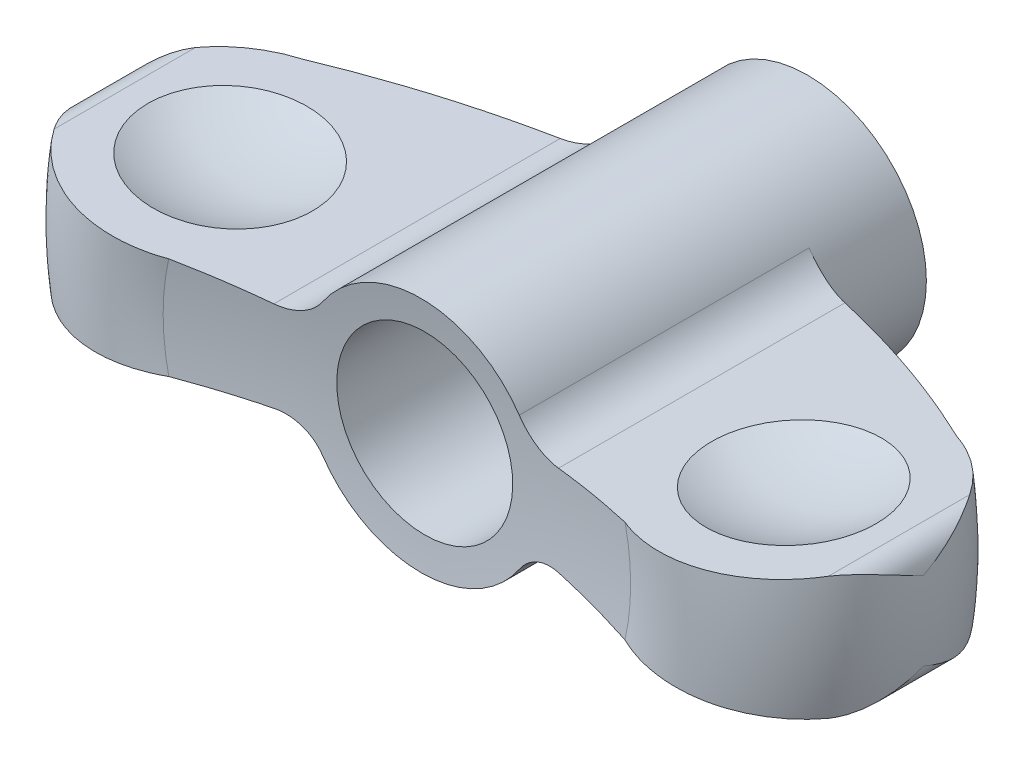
ISO-10303-21;
HEADER;
FILE_DESCRIPTION(('STEP AP214'),'2;1');
FILE_NAME('part.step','',(''),(''),'','','');
FILE_SCHEMA(('AUTOMOTIVE_DESIGN { 1 0 10303 214 1 1 1 1 }'));
ENDSEC;
DATA;
#1=APPLICATION_CONTEXT('core data for automotive mechanical design processes');
#2=APPLICATION_PROTOCOL_DEFINITION('international standard','automotive_design',2000,#1);
#3=PRODUCT_CONTEXT('',#1,'mechanical');
#4=PRODUCT('Part','Part','',(#3));
#5=PRODUCT_RELATED_PRODUCT_CATEGORY('part','',(#4));
#6=PRODUCT_DEFINITION_FORMATION('','',#4);
#7=PRODUCT_DEFINITION_CONTEXT('part definition',#1,'design');
#8=PRODUCT_DEFINITION('design','',#6,#7);
#9=PRODUCT_DEFINITION_SHAPE('','',#8);
#10=(LENGTH_UNIT() NAMED_UNIT(*) SI_UNIT(.MILLI.,.METRE.));
#11=(NAMED_UNIT(*) PLANE_ANGLE_UNIT() SI_UNIT($,.RADIAN.));
#12=(NAMED_UNIT(*) SI_UNIT($,.STERADIAN.) SOLID_ANGLE_UNIT());
#13=UNCERTAINTY_MEASURE_WITH_UNIT(LENGTH_MEASURE(1.E-05),#10,'distance_accuracy_value','');
#14=(GEOMETRIC_REPRESENTATION_CONTEXT(3) GLOBAL_UNCERTAINTY_ASSIGNED_CONTEXT((#13)) GLOBAL_UNIT_ASSIGNED_CONTEXT((#10,
#11,#12)) REPRESENTATION_CONTEXT('',''));
#15=CARTESIAN_POINT('',(0.,0.,0.));
#16=DIRECTION('',(0.,0.,1.));
#17=DIRECTION('',(1.,0.,0.));
#18=AXIS2_PLACEMENT_3D('',#15,#16,#17);
#19=CARTESIAN_POINT('',(0.,0.,16.8));
#20=DIRECTION('',(0.,0.,1.));
#21=DIRECTION('',(5.59811363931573E-11,-1.,0.));
#22=AXIS2_PLACEMENT_3D('',#19,#20,#21);
#23=TOROIDAL_SURFACE('',#22,16.3000000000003,7.2);
#24=CARTESIAN_POINT('',(13.4430070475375,2.92809317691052,10.0635861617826));
#25=CARTESIAN_POINT('',(13.2500457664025,2.91519660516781,10.1357408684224));
#26=CARTESIAN_POINT('',(13.0601324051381,2.90250374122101,10.2160710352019));
#27=CARTESIAN_POINT('',(12.6877100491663,2.87761288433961,10.3924240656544));
#28=CARTESIAN_POINT('',(12.5052008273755,2.86541487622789,10.4884464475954));
#29=CARTESIAN_POINT('',(12.148919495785,2.84160280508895,10.6955091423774));
#30=CARTESIAN_POINT('',(11.9751456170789,2.82998862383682,10.8065463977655));
#31=CARTESIAN_POINT('',(11.6375334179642,2.80742430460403,11.0428740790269));
#32=CARTESIAN_POINT('',(11.4736949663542,2.7964741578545,11.1681643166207));
#33=CARTESIAN_POINT('',(11.1570734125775,2.77531274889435,11.4321870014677));
#34=CARTESIAN_POINT('',(11.0042945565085,2.76510177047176,11.5709245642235));
#35=CARTESIAN_POINT('',(10.7109328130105,2.74549493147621,11.8608983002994));
#36=CARTESIAN_POINT('',(10.5703541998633,2.73609935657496,12.0121388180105));
#37=CARTESIAN_POINT('',(10.3025713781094,2.71820208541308,12.3259661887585));
#38=CARTESIAN_POINT('',(10.1753613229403,2.70969999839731,12.4885480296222));
#39=CARTESIAN_POINT('',(9.93523518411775,2.69365116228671,12.8239887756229));
#40=CARTESIAN_POINT('',(9.82231883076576,2.68610439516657,12.9968474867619));
#41=CARTESIAN_POINT('',(9.61240942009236,2.67207509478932,13.3504168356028));
#42=CARTESIAN_POINT('',(9.51531257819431,2.66558562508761,13.5310655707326));
#43=CARTESIAN_POINT('',(9.33694719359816,2.65366457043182,13.8999735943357));
#44=CARTESIAN_POINT('',(9.25567307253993,2.64823261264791,14.088230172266));
#45=CARTESIAN_POINT('',(9.1095973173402,2.63846963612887,14.4711021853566));
#46=CARTESIAN_POINT('',(9.04479892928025,2.63413883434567,14.6657188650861));
#47=CARTESIAN_POINT('',(8.93227844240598,2.62661852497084,15.0598492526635));
#48=CARTESIAN_POINT('',(8.88455601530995,2.62342899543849,15.2593628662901));
#49=CARTESIAN_POINT('',(8.80746852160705,2.61827685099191,15.6574650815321));
#50=CARTESIAN_POINT('',(8.77773054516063,2.61628931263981,15.8559812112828));
#51=CARTESIAN_POINT('',(8.73529826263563,2.61345335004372,16.2548338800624));
#52=CARTESIAN_POINT('',(8.72260367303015,2.61260490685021,16.4551703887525));
#53=CARTESIAN_POINT('',(8.71437606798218,2.61205501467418,16.8561671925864));
#54=CARTESIAN_POINT('',(8.71884052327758,2.61235339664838,17.0568274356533));
#55=CARTESIAN_POINT('',(8.74488386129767,2.61409400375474,17.457028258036));
#56=CARTESIAN_POINT('',(8.76646264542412,2.61553622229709,17.6565688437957));
#57=CARTESIAN_POINT('',(8.82608238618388,2.61952090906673,18.0500864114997));
#58=CARTESIAN_POINT('',(8.86387061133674,2.6220464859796,18.2441019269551));
#59=CARTESIAN_POINT('',(8.95554073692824,2.6281732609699,18.6283441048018));
#60=CARTESIAN_POINT('',(9.00942811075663,2.63177482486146,18.8185694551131));
#61=CARTESIAN_POINT('',(9.13281555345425,2.64002142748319,19.1937999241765));
#62=CARTESIAN_POINT('',(9.20231107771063,2.64466616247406,19.3788065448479));
#63=CARTESIAN_POINT('',(9.35638258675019,2.6549635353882,19.7424794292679));
#64=CARTESIAN_POINT('',(9.44096421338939,2.66061655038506,19.9211432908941));
#65=CARTESIAN_POINT('',(9.62545322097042,2.67294687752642,20.2726485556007));
#66=CARTESIAN_POINT('',(9.72550696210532,2.67963397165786,20.4454127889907));
#67=CARTESIAN_POINT('',(9.93957002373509,2.69394088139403,20.7821124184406));
#68=CARTESIAN_POINT('',(10.0535844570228,2.70156103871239,20.9460445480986));
#69=CARTESIAN_POINT('',(10.294658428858,2.71767322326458,21.2638986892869));
#70=CARTESIAN_POINT('',(10.4217143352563,2.72616500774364,21.4178234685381));
#71=CARTESIAN_POINT('',(10.6880299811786,2.74396422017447,21.714770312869));
#72=CARTESIAN_POINT('',(10.8272940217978,2.75327193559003,21.8577885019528));
#73=CARTESIAN_POINT('',(11.1201972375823,2.77284812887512,22.1349543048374));
#74=CARTESIAN_POINT('',(11.274084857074,2.78313321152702,22.2688382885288));
#75=CARTESIAN_POINT('',(11.5924511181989,2.80441122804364,22.5232972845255));
#76=CARTESIAN_POINT('',(11.7569299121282,2.81540417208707,22.6438721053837));
#77=CARTESIAN_POINT('',(12.0953583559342,2.83802304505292,22.8709220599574));
#78=CARTESIAN_POINT('',(12.2693100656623,2.84964911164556,22.9773941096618));
#79=CARTESIAN_POINT('',(12.6253835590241,2.87344729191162,23.175449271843));
#80=CARTESIAN_POINT('',(12.8075027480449,2.88561923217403,23.267037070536));
#81=CARTESIAN_POINT('',(13.1810420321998,2.9105847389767,23.4357878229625));
#82=CARTESIAN_POINT('',(13.3725503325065,2.92338420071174,23.5127547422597));
#83=CARTESIAN_POINT('',(13.7613485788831,2.94936954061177,23.6502587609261));
#84=CARTESIAN_POINT('',(13.9586384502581,2.96255541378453,23.7107960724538));
#85=CARTESIAN_POINT('',(14.357615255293,2.98922103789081,23.8149976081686));
#86=CARTESIAN_POINT('',(14.559302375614,3.00270080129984,23.8586611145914));
#87=CARTESIAN_POINT('',(14.9656299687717,3.02985771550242,23.9287762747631));
#88=CARTESIAN_POINT('',(15.1702703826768,3.04353486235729,23.955228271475));
#89=CARTESIAN_POINT('',(15.5810553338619,3.070989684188,23.9907056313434));
#90=CARTESIAN_POINT('',(15.7871999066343,3.08476736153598,23.999730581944));
#91=CARTESIAN_POINT('',(16.1994347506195,3.11231908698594,24.000257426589));
#92=CARTESIAN_POINT('',(16.4055250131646,3.12609313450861,23.9917658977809));
#93=CARTESIAN_POINT('',(16.8162992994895,3.15354724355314,23.9572980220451));
#94=CARTESIAN_POINT('',(17.0209829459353,3.16722727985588,23.9313171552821));
#95=CARTESIAN_POINT('',(17.4273317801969,3.19438561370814,23.8620348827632));
#96=CARTESIAN_POINT('',(17.6289980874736,3.20786398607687,23.8187400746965));
#97=CARTESIAN_POINT('',(18.0267250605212,3.23444607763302,23.7154246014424));
#98=CARTESIAN_POINT('',(18.2228121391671,3.24755156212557,23.6555060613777));
#99=CARTESIAN_POINT('',(18.6091495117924,3.27337242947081,23.5192613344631));
#100=CARTESIAN_POINT('',(18.7994018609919,3.28608794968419,23.4429410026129));
#101=CARTESIAN_POINT('',(19.172892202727,3.31105018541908,23.27434465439));
#102=CARTESIAN_POINT('',(19.3561252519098,3.3232965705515,23.1820576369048));
#103=CARTESIAN_POINT('',(19.7140940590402,3.34722142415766,22.9822113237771));
#104=CARTESIAN_POINT('',(19.8888301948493,3.35889991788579,22.8746527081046));
#105=CARTESIAN_POINT('',(20.2275235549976,3.38153649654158,22.6457025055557));
#106=CARTESIAN_POINT('',(20.3915386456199,3.39249844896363,22.5243968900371));
#107=CARTESIAN_POINT('',(20.708721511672,3.41369737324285,22.2682963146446));
#108=CARTESIAN_POINT('',(20.8618896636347,3.4239343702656,22.1335018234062));
#109=CARTESIAN_POINT('',(21.1559703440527,3.44358925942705,21.8516648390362));
#110=CARTESIAN_POINT('',(21.2969064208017,3.45300872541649,21.7046469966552));
#111=CARTESIAN_POINT('',(21.5657772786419,3.47097871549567,21.39923468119));
#112=CARTESIAN_POINT('',(21.6937203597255,3.4795297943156,21.2408475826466));
#113=CARTESIAN_POINT('',(21.8466005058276,3.48974754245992,21.0342564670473));
#114=CARTESIAN_POINT('',(21.8780226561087,3.49184764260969,20.9907857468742));
#115=CARTESIAN_POINT('',(21.9398602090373,3.49598055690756,20.9031903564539));
#116=CARTESIAN_POINT('',(21.9702765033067,3.49801343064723,20.8590663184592));
#117=CARTESIAN_POINT('',(22.0002000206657,3.50001336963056,20.8146028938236));
#118=B_SPLINE_CURVE_WITH_KNOTS('',3,(#24,#25,#26,#27,#28,#29,#30,#31,#32,#33,#34,#35,#36,#37,
#38,#39,#40,#41,#42,#43,#44,#45,#46,#47,#48,#49,#50,#51,#52,#53,#54,#55,#56,#57,#58,#59,#60,#61,
#62,#63,#64,#65,#66,#67,#68,#69,#70,#71,#72,#73,#74,#75,#76,#77,#78,#79,#80,#81,#82,#83,#84,#85,
#86,#87,#88,#89,#90,#91,#92,#93,#94,#95,#96,#97,#98,#99,#100,#101,#102,#103,#104,#105,#106,#107,
#108,#109,#110,#111,#112,#113,#114,#115,#116,#117),.UNSPECIFIED.,.F.,.F.,(4,2,2,2,2,2,2,2,2,2,2,
2,2,2,2,2,2,2,2,2,2,2,2,2,2,2,2,2,2,2,2,2,2,2,2,2,2,2,2,2,2,2,2,2,2,2,4),(0.,0.619053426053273,
1.23808785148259,1.85699641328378,2.47589680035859,3.09503355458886,3.71438635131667,
4.33346714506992,4.95253625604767,5.56736438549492,6.18197536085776,6.79670733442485,
7.41142748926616,8.01292036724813,8.61440323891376,9.21579745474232,9.81718820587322,
10.4095249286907,11.0020632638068,11.5944292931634,12.1870173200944,12.785599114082,
13.3844007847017,13.9830361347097,14.5818832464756,15.1938756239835,15.8058768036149,
16.4180115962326,17.0299532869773,17.6495959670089,18.2692306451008,18.8888916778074,
19.508540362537,20.1282037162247,20.7476344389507,21.3672253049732,21.9865802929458,
22.602211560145,23.2176234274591,23.8334610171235,24.4492711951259,25.0614231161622,
25.6735537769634,26.2844785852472,26.8950106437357,27.056040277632,27.2169231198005),.UNSPECIFIED.);
#119=CARTESIAN_POINT('',(12.9627653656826,2.89599621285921,23.3370956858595));
#120=VERTEX_POINT('',#119);
#121=CARTESIAN_POINT('',(22.0000000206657,3.50000000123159,20.814900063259));
#122=VERTEX_POINT('',#121);
#123=EDGE_CURVE('E175',#120,#122,#118,.T.);
#124=ORIENTED_EDGE('',*,*,#123,.F.);
#125=CARTESIAN_POINT('',(0.,0.,23.3370956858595));
#126=DIRECTION('',(0.,0.,1.));
#127=DIRECTION('',(5.59811363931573E-11,-1.,0.));
#128=AXIS2_PLACEMENT_3D('',#125,#126,#127);
#129=CIRCLE('',#128,13.2823220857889);
#130=CARTESIAN_POINT('',(12.9627653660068,-2.89599621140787,23.3370956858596));
#131=VERTEX_POINT('',#130);
#132=EDGE_CURVE('E187',#131,#120,#129,.T.);
#133=ORIENTED_EDGE('',*,*,#132,.F.);
#134=CARTESIAN_POINT('',(22.000200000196,-3.50001336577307,20.8146029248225));
#135=CARTESIAN_POINT('',(21.8869659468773,-3.49244536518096,20.9829001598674));
#136=CARTESIAN_POINT('',(21.7665908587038,-3.48440009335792,21.1463645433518));
#137=CARTESIAN_POINT('',(21.5125154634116,-3.46741895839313,21.4625195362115));
#138=CARTESIAN_POINT('',(21.3788160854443,-3.45848315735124,21.6152108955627));
#139=CARTESIAN_POINT('',(21.0991608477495,-3.43979239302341,21.9086013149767));
#140=CARTESIAN_POINT('',(20.9532163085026,-3.43003818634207,22.0493112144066));
#141=CARTESIAN_POINT('',(20.650023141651,-3.40977426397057,22.3179109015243));
#142=CARTESIAN_POINT('',(20.4927745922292,-3.39926455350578,22.4458007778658));
#143=CARTESIAN_POINT('',(20.1680719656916,-3.37756304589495,22.6878898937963));
#144=CARTESIAN_POINT('',(20.0006161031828,-3.36637112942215,22.8020867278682));
#145=CARTESIAN_POINT('',(19.6566594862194,-3.34338278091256,23.0160136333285));
#146=CARTESIAN_POINT('',(19.4801554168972,-3.33158612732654,23.1157383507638));
#147=CARTESIAN_POINT('',(19.1195107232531,-3.30748243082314,23.2999405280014));
#148=CARTESIAN_POINT('',(18.9353740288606,-3.29517565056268,23.3844257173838));
#149=CARTESIAN_POINT('',(18.5606181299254,-3.27012883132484,23.5376689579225));
#150=CARTESIAN_POINT('',(18.3699965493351,-3.25738863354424,23.6064211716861));
#151=CARTESIAN_POINT('',(17.983036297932,-3.23152613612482,23.7279050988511));
#152=CARTESIAN_POINT('',(17.7866806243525,-3.21840270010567,23.7805824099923));
#153=CARTESIAN_POINT('',(17.390183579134,-3.19190281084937,23.8692781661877));
#154=CARTESIAN_POINT('',(17.1900408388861,-3.1785262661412,23.9052904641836));
#155=CARTESIAN_POINT('',(16.7874574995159,-3.15161959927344,23.9604036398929));
#156=CARTESIAN_POINT('',(16.585016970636,-3.13808948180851,23.9795050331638));
#157=CARTESIAN_POINT('',(16.1792478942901,-3.11096989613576,24.0006952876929));
#158=CARTESIAN_POINT('',(15.9759193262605,-3.09738042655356,24.0027837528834));
#159=CARTESIAN_POINT('',(15.5684666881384,-3.07014831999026,23.9899203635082));
#160=CARTESIAN_POINT('',(15.3643461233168,-3.05650591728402,23.9748568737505));
#161=CARTESIAN_POINT('',(14.9580777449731,-3.0293529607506,23.9276425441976));
#162=CARTESIAN_POINT('',(14.7559299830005,-3.01584241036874,23.8954912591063));
#163=CARTESIAN_POINT('',(14.3550670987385,-2.98905073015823,23.8143605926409));
#164=CARTESIAN_POINT('',(14.1563513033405,-2.97576955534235,23.7653845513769));
#165=CARTESIAN_POINT('',(13.763633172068,-2.94952222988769,23.6509482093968));
#166=CARTESIAN_POINT('',(13.5696323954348,-2.93655618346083,23.5854825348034));
#167=CARTESIAN_POINT('',(13.1865164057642,-2.91095061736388,23.4380671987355));
#168=CARTESIAN_POINT('',(12.9974412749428,-2.89831377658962,23.3560128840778));
#169=CARTESIAN_POINT('',(12.6268363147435,-2.8735443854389,23.1762764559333));
#170=CARTESIAN_POINT('',(12.4453065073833,-2.861411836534,23.0785942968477));
#171=CARTESIAN_POINT('',(12.0910342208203,-2.83773404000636,22.8682633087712));
#172=CARTESIAN_POINT('',(11.9182938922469,-2.82618893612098,22.7556108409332));
#173=CARTESIAN_POINT('',(11.5829402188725,-2.80377556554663,22.5161828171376));
#174=CARTESIAN_POINT('',(11.420323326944,-2.79290706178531,22.3894122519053));
#175=CARTESIAN_POINT('',(11.1059013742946,-2.77189266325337,22.1222291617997));
#176=CARTESIAN_POINT('',(10.9541266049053,-2.7617487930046,21.9817808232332));
#177=CARTESIAN_POINT('',(10.6630509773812,-2.74229474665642,21.6885550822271));
#178=CARTESIAN_POINT('',(10.5237454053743,-2.73298425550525,21.5357823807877));
#179=CARTESIAN_POINT('',(10.2585504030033,-2.71525994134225,21.2188580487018));
#180=CARTESIAN_POINT('',(10.1326659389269,-2.70684645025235,21.0547022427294));
#181=CARTESIAN_POINT('',(9.89540453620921,-2.69098907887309,20.7162706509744));
#182=CARTESIAN_POINT('',(9.7840218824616,-2.68354481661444,20.5419988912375));
#183=CARTESIAN_POINT('',(9.57753567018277,-2.66974430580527,20.1860989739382));
#184=CARTESIAN_POINT('',(9.48229586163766,-2.66337895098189,20.0045502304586));
#185=CARTESIAN_POINT('',(9.30772151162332,-2.65171127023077,19.6340070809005));
#186=CARTESIAN_POINT('',(9.22838099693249,-2.64640854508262,19.4450155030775));
#187=CARTESIAN_POINT('',(9.08624438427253,-2.63690884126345,19.0608700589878));
#188=CARTESIAN_POINT('',(9.02344908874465,-2.63271191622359,18.8657158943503));
#189=CARTESIAN_POINT('',(8.91497467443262,-2.62546202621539,18.4706862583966));
#190=CARTESIAN_POINT('',(8.86929523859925,-2.62240904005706,18.2708108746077));
#191=CARTESIAN_POINT('',(8.79627719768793,-2.61752887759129,17.8722020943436));
#192=CARTESIAN_POINT('',(8.7685625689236,-2.61567656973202,17.6735378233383));
#193=CARTESIAN_POINT('',(8.73017446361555,-2.61311089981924,17.2745631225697));
#194=CARTESIAN_POINT('',(8.71950071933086,-2.61239751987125,17.0742527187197));
#195=CARTESIAN_POINT('',(8.71529310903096,-2.61211630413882,16.673466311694));
#196=CARTESIAN_POINT('',(8.72175798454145,-2.6125483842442,16.4729903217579));
#197=CARTESIAN_POINT('',(8.75176494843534,-2.61455390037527,16.0733272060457));
#198=CARTESIAN_POINT('',(8.77530694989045,-2.6161273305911,15.8741400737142));
#199=CARTESIAN_POINT('',(8.83878915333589,-2.62037016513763,15.4813635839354));
#200=CARTESIAN_POINT('',(8.87848770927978,-2.62302341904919,15.2877349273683));
#201=CARTESIAN_POINT('',(8.9739310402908,-2.62940237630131,14.9044232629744));
#202=CARTESIAN_POINT('',(9.02968125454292,-2.63312844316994,14.7147416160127));
#203=CARTESIAN_POINT('',(9.15673580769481,-2.64162013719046,14.3407362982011));
#204=CARTESIAN_POINT('',(9.22803659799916,-2.64638552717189,14.1564114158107));
#205=CARTESIAN_POINT('',(9.38562068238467,-2.6569176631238,13.7943056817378));
#206=CARTESIAN_POINT('',(9.4719045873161,-2.66268444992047,13.6165250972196));
#207=CARTESIAN_POINT('',(9.65980249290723,-2.67524261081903,13.266777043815));
#208=CARTESIAN_POINT('',(9.76157423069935,-2.68204452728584,13.0948947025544));
#209=CARTESIAN_POINT('',(9.97895442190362,-2.69657313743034,12.7601587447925));
#210=CARTESIAN_POINT('',(10.0945629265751,-2.70429983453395,12.5973051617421));
#211=CARTESIAN_POINT('',(10.338828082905,-2.7206253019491,12.2815998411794));
#212=CARTESIAN_POINT('',(10.4674919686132,-2.72922455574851,12.1287537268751));
#213=CARTESIAN_POINT('',(10.7368892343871,-2.74722972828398,11.83415215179));
#214=CARTESIAN_POINT('',(10.8776225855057,-2.75663564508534,11.6923966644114));
#215=CARTESIAN_POINT('',(11.1735584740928,-2.77641452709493,11.4177499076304));
#216=CARTESIAN_POINT('',(11.3290201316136,-2.78680481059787,11.2851390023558));
#217=CARTESIAN_POINT('',(11.6503816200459,-2.80828301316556,11.0334204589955));
#218=CARTESIAN_POINT('',(11.816277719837,-2.81937068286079,10.9143080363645));
#219=CARTESIAN_POINT('',(12.1571151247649,-2.8421505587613,10.6905168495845));
#220=CARTESIAN_POINT('',(12.3320419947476,-2.85384180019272,10.5858159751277));
#221=CARTESIAN_POINT('',(12.6898958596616,-2.87775897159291,10.3913862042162));
#222=CARTESIAN_POINT('',(12.872818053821,-2.88998458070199,10.3016484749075));
#223=CARTESIAN_POINT('',(13.1223586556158,-2.90666263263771,10.1918600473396));
#224=CARTESIAN_POINT('',(13.186021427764,-2.91091753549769,10.1649193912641));
#225=CARTESIAN_POINT('',(13.3140099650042,-2.91947165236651,10.1128788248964));
#226=CARTESIAN_POINT('',(13.3783349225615,-2.92377081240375,10.0877769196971));
#227=CARTESIAN_POINT('',(13.4430070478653,-2.92809317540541,10.0635861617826));
#228=B_SPLINE_CURVE_WITH_KNOTS('',3,(#134,#135,#136,#137,#138,#139,#140,#141,#142,#143,#144,
#145,#146,#147,#148,#149,#150,#151,#152,#153,#154,#155,#156,#157,#158,#159,#160,#161,#162,#163,
#164,#165,#166,#167,#168,#169,#170,#171,#172,#173,#174,#175,#176,#177,#178,#179,#180,#181,#182,
#183,#184,#185,#186,#187,#188,#189,#190,#191,#192,#193,#194,#195,#196,#197,#198,#199,#200,#201,
#202,#203,#204,#205,#206,#207,#208,#209,#210,#211,#212,#213,#214,#215,#216,#217,#218,#219,#220,
#221,#222,#223,#224,#225,#226,#227),.UNSPECIFIED.,.F.,.F.,(4,2,2,2,2,2,2,2,2,2,2,2,2,2,2,2,2,2,
2,2,2,2,2,2,2,2,2,2,2,2,2,2,2,2,2,2,2,2,2,2,2,2,2,2,2,2,4),(0.,0.608767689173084,
1.21749295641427,1.82566153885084,2.43382591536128,3.04209697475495,3.65059249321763,
4.25877850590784,4.86718980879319,5.47763788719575,6.0883109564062,6.69896540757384,
7.30963407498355,7.92430017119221,8.53898228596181,9.15354244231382,9.76830314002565,
10.3870705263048,11.0058397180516,11.6247595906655,12.2434613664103,12.8638290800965,
13.4839612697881,14.1043221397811,14.7244377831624,15.3390262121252,15.9533833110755,
16.5677702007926,17.1821457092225,17.7832066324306,18.3842581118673,18.9852654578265,
19.5862697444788,20.1785973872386,20.7711259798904,21.3635195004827,21.9559371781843,
22.554851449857,23.1537679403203,23.7530181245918,24.3522668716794,24.9653566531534,
25.5782284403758,26.1901492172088,26.8017074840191,27.0094652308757,27.2169941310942),.UNSPECIFIED.);
#229=CARTESIAN_POINT('',(22.0000000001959,-3.49999999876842,20.8149000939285));
#230=VERTEX_POINT('',#229);
#231=EDGE_CURVE('E289',#230,#131,#228,.T.);
#232=ORIENTED_EDGE('',*,*,#231,.F.);
#233=CARTESIAN_POINT('',(23.39366515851,-2.23303167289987,16.8));
#234=CARTESIAN_POINT('',(23.3934426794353,-2.23536251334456,16.8051493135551));
#235=CARTESIAN_POINT('',(23.3932143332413,-2.23769289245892,16.8102988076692));
#236=CARTESIAN_POINT('',(23.3743145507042,-2.42570444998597,17.2258528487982));
#237=CARTESIAN_POINT('',(23.3183956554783,-2.60830531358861,17.6373544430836));
#238=CARTESIAN_POINT('',(23.1798743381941,-2.8596587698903,18.2505518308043));
#239=CARTESIAN_POINT('',(23.1245479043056,-2.93972311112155,18.4543861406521));
#240=CARTESIAN_POINT('',(22.9956909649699,-3.0890981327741,18.8603432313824));
#241=CARTESIAN_POINT('',(22.9221687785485,-3.15841370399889,19.062466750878));
#242=CARTESIAN_POINT('',(22.7850793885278,-3.26116367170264,19.395929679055));
#243=CARTESIAN_POINT('',(22.7265638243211,-3.29880232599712,19.5280746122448));
#244=CARTESIAN_POINT('',(22.6018254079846,-3.36602668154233,19.7906656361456));
#245=CARTESIAN_POINT('',(22.5356088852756,-3.39561893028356,19.9211130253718));
#246=CARTESIAN_POINT('',(22.3953169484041,-3.44509635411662,20.1805136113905));
#247=CARTESIAN_POINT('',(22.321205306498,-3.46493421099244,20.3094566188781));
#248=CARTESIAN_POINT('',(22.2046559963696,-3.48552373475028,20.5007658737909));
#249=CARTESIAN_POINT('',(22.1648550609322,-3.49085996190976,20.5642643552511));
#250=CARTESIAN_POINT('',(22.0835651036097,-3.49809815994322,20.6904076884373));
#251=CARTESIAN_POINT('',(22.042075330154,-3.49999858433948,20.7530521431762));
#252=CARTESIAN_POINT('',(21.999800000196,-3.49999998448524,20.8151941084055));
#253=B_SPLINE_CURVE_WITH_KNOTS('',3,(#233,#234,#235,#236,#237,#238,#239,#240,#241,#242,#243,
#244,#245,#246,#247,#248,#249,#250,#251,#252),.UNSPECIFIED.,.F.,.F.,(4,2,2,2,2,2,2,2,2,4),(0.,
0.016970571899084,1.36944581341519,2.04642868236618,2.72310260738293,3.1707723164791,
3.61807665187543,4.06752994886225,4.2928318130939,4.51823506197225),.UNSPECIFIED.);
#254=CARTESIAN_POINT('',(23.3936651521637,-2.23303173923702,16.8));
#255=VERTEX_POINT('',#254);
#256=EDGE_CURVE('E346',#255,#230,#253,.T.);
#257=ORIENTED_EDGE('',*,*,#256,.F.);
#258=CARTESIAN_POINT('',(21.999800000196,-3.4999999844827,12.784805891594));
#259=CARTESIAN_POINT('',(22.0666741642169,-3.49996243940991,12.8830879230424));
#260=CARTESIAN_POINT('',(22.1315514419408,-3.49523252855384,12.9826100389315));
#261=CARTESIAN_POINT('',(22.2568815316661,-3.47769367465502,13.183511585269));
#262=CARTESIAN_POINT('',(22.317340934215,-3.46489705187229,13.2848879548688));
#263=CARTESIAN_POINT('',(22.4333648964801,-3.43259082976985,13.4887461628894));
#264=CARTESIAN_POINT('',(22.4889490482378,-3.41310980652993,13.5912215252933));
#265=CARTESIAN_POINT('',(22.5953729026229,-3.36841026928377,13.7974289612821));
#266=CARTESIAN_POINT('',(22.6462099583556,-3.34318858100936,13.901161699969));
#267=CARTESIAN_POINT('',(22.7740899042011,-3.2701146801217,14.1765334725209));
#268=CARTESIAN_POINT('',(22.8470051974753,-3.21812877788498,14.3490158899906));
#269=CARTESIAN_POINT('',(22.9794561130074,-3.10414337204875,14.6957451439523));
#270=CARTESIAN_POINT('',(23.0389856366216,-3.04213932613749,14.8699927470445));
#271=CARTESIAN_POINT('',(23.1975205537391,-2.84462859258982,15.3951794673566));
#272=CARTESIAN_POINT('',(23.276328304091,-2.69771476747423,15.7482515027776));
#273=CARTESIAN_POINT('',(23.3443046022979,-2.49442989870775,16.2153989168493));
#274=CARTESIAN_POINT('',(23.358023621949,-2.44419371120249,16.3292368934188));
#275=CARTESIAN_POINT('',(23.3797700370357,-2.34273549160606,16.5569077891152));
#276=CARTESIAN_POINT('',(23.3878040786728,-2.29151468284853,16.6707405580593));
#277=CARTESIAN_POINT('',(23.3932143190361,-2.23769296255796,16.7897010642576));
#278=CARTESIAN_POINT('',(23.3934426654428,-2.23536258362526,16.7948505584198));
#279=CARTESIAN_POINT('',(23.39366515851,-2.23303167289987,16.8));
#280=B_SPLINE_CURVE_WITH_KNOTS('',3,(#258,#259,#260,#261,#262,#263,#264,#265,#266,#267,#268,
#269,#270,#271,#272,#273,#274,#275,#276,#277,#278,#279),.UNSPECIFIED.,.F.,.F.,(4,2,2,2,2,2,2,2,
2,2,4),(0.,0.356372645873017,0.712202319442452,1.06652937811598,1.42105283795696,
2.00316709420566,2.58554603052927,3.75135617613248,4.12686584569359,4.50193578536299,
4.51890635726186),.UNSPECIFIED.);
#281=CARTESIAN_POINT('',(22.0000000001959,-3.49999999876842,12.7850999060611));
#282=VERTEX_POINT('',#281);
#283=EDGE_CURVE('E339',#282,#255,#280,.T.);
#284=ORIENTED_EDGE('',*,*,#283,.F.);
#285=CARTESIAN_POINT('',(18.5559048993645,-3.26981382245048,10.0635861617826));
#286=CARTESIAN_POINT('',(18.7481532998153,-3.28266274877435,10.1358408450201));
#287=CARTESIAN_POINT('',(18.9373210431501,-3.29530577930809,10.2163336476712));
#288=CARTESIAN_POINT('',(19.3081618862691,-3.32009093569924,10.3931469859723));
#289=CARTESIAN_POINT('',(19.4898343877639,-3.33223302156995,10.4894687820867));
#290=CARTESIAN_POINT('',(19.8398224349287,-3.35562448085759,10.6946430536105));
#291=CARTESIAN_POINT('',(20.0083599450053,-3.3668886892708,10.8031155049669));
#292=CARTESIAN_POINT('',(20.3358278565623,-3.38877501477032,11.0337190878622));
#293=CARTESIAN_POINT('',(20.494759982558,-3.39939724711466,11.1558477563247));
#294=CARTESIAN_POINT('',(20.7764213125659,-3.41822208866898,11.3915935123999));
#295=CARTESIAN_POINT('',(20.9007819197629,-3.42653373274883,11.5032605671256));
#296=CARTESIAN_POINT('',(21.1414563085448,-3.44261921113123,11.7349898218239));
#297=CARTESIAN_POINT('',(21.2577703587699,-3.45039306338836,11.8550517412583));
#298=CARTESIAN_POINT('',(21.4842055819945,-3.46552686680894,12.1056865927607));
#299=CARTESIAN_POINT('',(21.5941379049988,-3.47287419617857,12.236430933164));
#300=CARTESIAN_POINT('',(21.8044661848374,-3.48693149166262,12.5054420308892));
#301=CARTESIAN_POINT('',(21.9048606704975,-3.49364135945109,12.6437099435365));
#302=CARTESIAN_POINT('',(22.000200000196,-3.50001336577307,12.7853970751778));
#303=B_SPLINE_CURVE_WITH_KNOTS('',3,(#285,#286,#287,#288,#289,#290,#291,#292,#293,#294,#295,
#296,#297,#298,#299,#300,#301,#302),.UNSPECIFIED.,.F.,.F.,(4,2,2,2,2,2,2,2,4),(0.,
0.617158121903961,1.23436541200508,1.83590974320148,2.43734575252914,2.93898887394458,
3.44061523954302,3.95311321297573,4.46569010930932),.UNSPECIFIED.);
#304=CARTESIAN_POINT('',(18.5564367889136,-3.26984937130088,10.0637861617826));
#305=VERTEX_POINT('',#304);
#306=EDGE_CURVE('E280',#305,#282,#303,.T.);
#307=ORIENTED_EDGE('',*,*,#306,.F.);
#308=CARTESIAN_POINT('',(0.,0.,10.0637861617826));
#309=DIRECTION('',(0.,0.,1.));
#310=DIRECTION('',(5.59811363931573E-11,-1.,0.));
#311=AXIS2_PLACEMENT_3D('',#308,#309,#310);
#312=CIRCLE('',#311,18.8423263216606);
#313=CARTESIAN_POINT('',(18.5564367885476,3.2698493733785,10.0637861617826));
#314=VERTEX_POINT('',#313);
#315=EDGE_CURVE('E183',#305,#314,#312,.T.);
#316=ORIENTED_EDGE('',*,*,#315,.T.);
#317=CARTESIAN_POINT('',(22.0002000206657,3.50001336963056,12.7853971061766));
#318=CARTESIAN_POINT('',(21.8855721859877,3.49235221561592,12.6150255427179));
#319=CARTESIAN_POINT('',(21.7636225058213,3.48420170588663,12.4496052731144));
#320=CARTESIAN_POINT('',(21.506066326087,3.46698793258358,12.1298039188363));
#321=CARTESIAN_POINT('',(21.3704594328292,3.45792464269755,11.9754231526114));
#322=CARTESIAN_POINT('',(21.0901761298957,3.43919190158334,11.6826018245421));
#323=CARTESIAN_POINT('',(20.9458162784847,3.42954360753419,11.543856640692));
#324=CARTESIAN_POINT('',(20.6460984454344,3.40951195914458,11.2788991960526));
#325=CARTESIAN_POINT('',(20.4907422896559,3.39912872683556,11.1526848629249));
#326=CARTESIAN_POINT('',(20.1963110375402,3.3794504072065,10.933163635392));
#327=CARTESIAN_POINT('',(20.0587202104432,3.37025452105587,10.8378487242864));
#328=CARTESIAN_POINT('',(19.7772660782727,3.3514435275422,10.6570247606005));
#329=CARTESIAN_POINT('',(19.6334029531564,3.34182843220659,10.5715154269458));
#330=CARTESIAN_POINT('',(19.3369202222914,3.32201300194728,10.4089623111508));
#331=CARTESIAN_POINT('',(19.184178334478,3.31180449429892,10.3321425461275));
#332=CARTESIAN_POINT('',(18.8736362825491,3.29104940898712,10.1895126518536));
#333=CARTESIAN_POINT('',(18.7158354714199,3.28050278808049,10.1237039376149));
#334=CARTESIAN_POINT('',(18.5559048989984,3.26981382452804,10.0635861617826));
#335=B_SPLINE_CURVE_WITH_KNOTS('',3,(#317,#318,#319,#320,#321,#322,#323,#324,#325,#326,#327,
#328,#329,#330,#331,#332,#333,#334),.UNSPECIFIED.,.F.,.F.,(4,2,2,2,2,2,2,2,4),(0.,
0.616269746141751,1.23255726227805,1.83324114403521,2.43382551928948,2.93633271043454,
3.43882549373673,3.9522243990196,4.46568922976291),.UNSPECIFIED.);
#336=CARTESIAN_POINT('',(22.0000000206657,3.50000000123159,12.7850999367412));
#337=VERTEX_POINT('',#336);
#338=EDGE_CURVE('E297',#337,#314,#335,.T.);
#339=ORIENTED_EDGE('',*,*,#338,.F.);
#340=CARTESIAN_POINT('',(23.39366515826,2.23303167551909,16.8));
#341=CARTESIAN_POINT('',(23.3934426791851,2.2353625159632,16.7948506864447));
#342=CARTESIAN_POINT('',(23.3932143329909,2.237692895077,16.7897011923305));
#343=CARTESIAN_POINT('',(23.3743145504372,2.42570445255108,16.3741471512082));
#344=CARTESIAN_POINT('',(23.3183956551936,2.60830531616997,15.9626455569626));
#345=CARTESIAN_POINT('',(23.1798743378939,2.85965877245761,15.3494481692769));
#346=CARTESIAN_POINT('',(23.1245479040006,2.93972311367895,15.1456138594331));
#347=CARTESIAN_POINT('',(22.9956909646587,3.08909813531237,14.7396567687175));
#348=CARTESIAN_POINT('',(22.9221687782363,3.15841370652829,14.5375332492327));
#349=CARTESIAN_POINT('',(22.7850793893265,3.26116367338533,14.2040703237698));
#350=CARTESIAN_POINT('',(22.7265638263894,3.29880232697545,14.071925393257));
#351=CARTESIAN_POINT('',(22.6018254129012,3.36602668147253,13.809334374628));
#352=CARTESIAN_POINT('',(22.5356088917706,3.39561892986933,13.6788869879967));
#353=CARTESIAN_POINT('',(22.3953169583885,3.44509635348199,13.4194864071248));
#354=CARTESIAN_POINT('',(22.3212053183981,3.46493421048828,13.2905434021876));
#355=CARTESIAN_POINT('',(22.2046560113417,3.48552373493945,13.0992341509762));
#356=CARTESIAN_POINT('',(22.1648550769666,3.49085996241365,13.0357356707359));
#357=CARTESIAN_POINT('',(22.0835651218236,3.49809816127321,12.9095923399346));
#358=CARTESIAN_POINT('',(22.0420753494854,3.49999858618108,12.8469478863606));
#359=CARTESIAN_POINT('',(21.9998000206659,3.49999998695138,12.7848059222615));
#360=B_SPLINE_CURVE_WITH_KNOTS('',3,(#340,#341,#342,#343,#344,#345,#346,#347,#348,#349,#350,
#351,#352,#353,#354,#355,#356,#357,#358,#359),.UNSPECIFIED.,.F.,.F.,(4,2,2,2,2,2,2,2,2,4),(0.,
0.0169705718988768,1.36944581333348,2.04642868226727,2.72310260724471,3.17077230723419,
3.61807663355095,4.06752992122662,4.29283178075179,4.51823502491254),.UNSPECIFIED.);
#361=CARTESIAN_POINT('',(23.393665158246,2.23303167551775,16.8));
#362=VERTEX_POINT('',#361);
#363=EDGE_CURVE('E9',#362,#337,#360,.T.);
#364=ORIENTED_EDGE('',*,*,#363,.F.);
#365=CARTESIAN_POINT('',(21.9998000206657,3.49999998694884,20.8151940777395));
#366=CARTESIAN_POINT('',(22.0666741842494,3.49996244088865,20.7169120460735));
#367=CARTESIAN_POINT('',(22.1315514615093,3.49523252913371,20.6173899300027));
#368=CARTESIAN_POINT('',(22.2568815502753,3.47769367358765,20.4164883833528));
#369=CARTESIAN_POINT('',(22.3173409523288,3.46489705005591,20.3151120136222));
#370=CARTESIAN_POINT('',(22.4333649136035,3.43259082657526,20.1112538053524));
#371=CARTESIAN_POINT('',(22.4889490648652,3.41310980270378,20.0087784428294));
#372=CARTESIAN_POINT('',(22.5953729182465,3.36841026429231,19.8025710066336));
#373=CARTESIAN_POINT('',(22.6462099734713,3.34318857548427,19.6988382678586));
#374=CARTESIAN_POINT('',(22.774089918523,3.27011467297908,19.4234664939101));
#375=CARTESIAN_POINT('',(22.8470052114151,3.21812876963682,19.2509840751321));
#376=CARTESIAN_POINT('',(22.979456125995,3.10414336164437,18.9042548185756));
#377=CARTESIAN_POINT('',(23.0389856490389,3.04213931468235,18.7300072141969));
#378=CARTESIAN_POINT('',(23.1975205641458,2.84462857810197,18.2048204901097));
#379=CARTESIAN_POINT('',(23.2763283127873,2.6977147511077,17.8517484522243));
#380=CARTESIAN_POINT('',(23.3443046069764,2.4944298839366,17.3846010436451));
#381=CARTESIAN_POINT('',(23.3580236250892,2.44419369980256,17.2707630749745));
#382=CARTESIAN_POINT('',(23.3797700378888,2.3427354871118,17.0430921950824));
#383=CARTESIAN_POINT('',(23.3878040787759,2.29151468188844,16.9292594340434));
#384=CARTESIAN_POINT('',(23.3932143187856,2.23769296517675,16.8102989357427));
#385=CARTESIAN_POINT('',(23.3934426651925,2.23536258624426,16.8051494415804));
#386=CARTESIAN_POINT('',(23.39366515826,2.23303167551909,16.8));
#387=B_SPLINE_CURVE_WITH_KNOTS('',3,(#365,#366,#367,#368,#369,#370,#371,#372,#373,#374,#375,
#376,#377,#378,#379,#380,#381,#382,#383,#384,#385,#386),.UNSPECIFIED.,.F.,.F.,(4,2,2,2,2,2,2,2,
2,2,4),(0.,0.356372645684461,0.712202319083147,1.06652937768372,1.42105283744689,
2.00316709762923,2.58554603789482,3.75135619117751,4.12686583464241,4.50193574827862,
4.51890632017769),.UNSPECIFIED.);
#388=EDGE_CURVE('E28',#122,#362,#387,.T.);
#389=ORIENTED_EDGE('',*,*,#388,.F.);
#390=EDGE_LOOP('',(#124,#133,#232,#257,#284,#307,#316,#339,#364,#389));
#391=FACE_BOUND('',#390,.T.);
#392=ADVANCED_FACE('F14',(#391),#23,.T.);
#393=CARTESIAN_POINT('',(0.,0.,60.8916836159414));
#394=DIRECTION('',(0.,0.,1.));
#395=DIRECTION('',(5.59811363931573E-11,-1.,0.));
#396=AXIS2_PLACEMENT_3D('',#393,#394,#395);
#397=DEGENERATE_TOROIDAL_SURFACE('',#396,7.24809636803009,57.1330492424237,.F.);
#398=CARTESIAN_POINT('',(0.,0.,5.5));
#399=DIRECTION('',(0.,0.,1.));
#400=DIRECTION('',(5.59811363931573E-11,-1.,0.));
#401=AXIS2_PLACEMENT_3D('',#398,#399,#400);
#402=CIRCLE('',#401,6.75);
#403=CARTESIAN_POINT('',(-5.58468393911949,3.79128016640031,5.5));
#404=VERTEX_POINT('',#403);
#405=CARTESIAN_POINT('',(-5.58468393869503,-3.79128016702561,5.5));
#406=VERTEX_POINT('',#405);
#407=EDGE_CURVE('E162',#404,#406,#402,.T.);
#408=ORIENTED_EDGE('',*,*,#407,.T.);
#409=CARTESIAN_POINT('',(-5.58454817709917,-3.79148016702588,5.50000000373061));
#410=CARTESIAN_POINT('',(-5.62703500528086,-3.72886637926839,5.49999203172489));
#411=CARTESIAN_POINT('',(-5.67207292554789,-3.66799067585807,5.50109190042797));
#412=CARTESIAN_POINT('',(-5.76687239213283,-3.55013742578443,5.5054646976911));
#413=CARTESIAN_POINT('',(-5.81663303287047,-3.49315913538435,5.5087372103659));
#414=CARTESIAN_POINT('',(-5.92037232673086,-3.38365000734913,5.51740071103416));
#415=CARTESIAN_POINT('',(-5.974338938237,-3.33110730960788,5.5227858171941));
#416=CARTESIAN_POINT('',(-6.0861731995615,-3.23065312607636,5.53558959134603));
#417=CARTESIAN_POINT('',(-6.14404090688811,-3.18274170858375,5.54300828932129));
#418=CARTESIAN_POINT('',(-6.32281948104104,-3.04645743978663,5.56816484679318));
#419=CARTESIAN_POINT('',(-6.44903201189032,-2.96540189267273,5.58881397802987));
#420=CARTESIAN_POINT('',(-6.71175482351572,-2.82481579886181,5.63683026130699));
#421=CARTESIAN_POINT('',(-6.84827321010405,-2.76530241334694,5.66420274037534));
#422=CARTESIAN_POINT('',(-7.13180529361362,-2.66747892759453,5.72532830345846));
#423=CARTESIAN_POINT('',(-7.27900617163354,-2.62981214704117,5.75923917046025));
#424=CARTESIAN_POINT('',(-7.57631968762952,-2.5788044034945,5.83159976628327));
#425=CARTESIAN_POINT('',(-7.726428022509,-2.56542990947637,5.87004316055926));
#426=CARTESIAN_POINT('',(-7.91146899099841,-2.56375196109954,5.9195986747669));
#427=CARTESIAN_POINT('',(-7.94691227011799,-2.56410633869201,5.92918950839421));
#428=CARTESIAN_POINT('',(-8.01766035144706,-2.56615563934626,5.94852854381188));
#429=CARTESIAN_POINT('',(-8.05296528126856,-2.56784856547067,5.958276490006));
#430=CARTESIAN_POINT('',(-8.0882150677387,-2.57020553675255,5.96810530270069));
#431=B_SPLINE_CURVE_WITH_KNOTS('',3,(#409,#410,#411,#412,#413,#414,#415,#416,#417,#418,#419,
#420,#421,#422,#423,#424,#425,#426,#427,#428,#429,#430),.UNSPECIFIED.,.F.,.F.,(4,2,2,2,2,2,2,2,
2,2,4),(0.,0.226923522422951,0.453803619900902,0.680056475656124,0.906312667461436,
1.35828167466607,1.81060994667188,2.27565813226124,2.74006391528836,2.85020967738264,
2.96019142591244),.UNSPECIFIED.);
#432=CARTESIAN_POINT('',(-8.0880150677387,-2.57019216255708,5.96804953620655));
#433=VERTEX_POINT('',#432);
#434=EDGE_CURVE('E151',#406,#433,#431,.T.);
#435=ORIENTED_EDGE('',*,*,#434,.T.);
#436=CARTESIAN_POINT('',(-18.5568278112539,-3.26987550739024,10.0639861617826));
#437=CARTESIAN_POINT('',(-17.7202118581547,-3.21396026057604,9.63606709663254));
#438=CARTESIAN_POINT('',(-16.8730027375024,-3.15733701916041,9.22898268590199));
#439=CARTESIAN_POINT('',(-15.1615683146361,-3.04295325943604,8.45851890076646));
#440=CARTESIAN_POINT('',(-14.2973907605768,-2.98519593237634,8.09503297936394));
#441=CARTESIAN_POINT('',(-12.5519653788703,-2.868540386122,7.4116445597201));
#442=CARTESIAN_POINT('',(-11.6707170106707,-2.80964213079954,7.09174344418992));
#443=CARTESIAN_POINT('',(-10.3366076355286,-2.72047689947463,6.64515483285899));
#444=CARTESIAN_POINT('',(-9.88928279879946,-2.69057993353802,6.50167304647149));
#445=CARTESIAN_POINT('',(-8.99112522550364,-2.63055155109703,6.22618011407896));
#446=CARTESIAN_POINT('',(-8.54029244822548,-2.60042013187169,6.0941691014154));
#447=CARTESIAN_POINT('',(-8.0878150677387,-2.5701787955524,5.96799377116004));
#448=B_SPLINE_CURVE_WITH_KNOTS('',3,(#436,#437,#438,#439,#440,#441,#442,#443,#444,#445,#446,
#447),.UNSPECIFIED.,.F.,.F.,(4,2,2,2,2,4),(0.,2.82377208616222,5.64049635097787,
8.45730995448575,9.86934742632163,11.2814013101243),.UNSPECIFIED.);
#449=CARTESIAN_POINT('',(-18.5564367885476,-3.2698493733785,10.0637861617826));
#450=VERTEX_POINT('',#449);
#451=EDGE_CURVE('E210',#450,#433,#448,.T.);
#452=ORIENTED_EDGE('',*,*,#451,.F.);
#453=CARTESIAN_POINT('',(-18.5564367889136,3.26984937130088,10.0637861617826));
#454=VERTEX_POINT('',#453);
#455=EDGE_CURVE('E182',#454,#450,#312,.T.);
#456=ORIENTED_EDGE('',*,*,#455,.F.);
#457=CARTESIAN_POINT('',(-8.08781506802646,2.57017879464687,5.96799377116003));
#458=CARTESIAN_POINT('',(-8.43648524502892,2.59348217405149,6.06521586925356));
#459=CARTESIAN_POINT('',(-8.78418982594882,2.61672101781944,6.16591362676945));
#460=CARTESIAN_POINT('',(-9.47752423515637,2.66306003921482,6.37414417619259));
#461=CARTESIAN_POINT('',(-9.8231542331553,2.68616022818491,6.48167640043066));
#462=CARTESIAN_POINT('',(-10.8568675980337,2.75524848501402,6.81439605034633));
#463=CARTESIAN_POINT('',(-11.5417095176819,2.8010199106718,7.04968835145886));
#464=CARTESIAN_POINT('',(-13.5766416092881,2.93702464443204,7.7931914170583));
#465=CARTESIAN_POINT('',(-14.9128146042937,3.02632779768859,8.34061833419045));
#466=CARTESIAN_POINT('',(-16.618242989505,3.14031014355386,9.11672807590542));
#467=CARTESIAN_POINT('',(-17.0086949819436,3.16640601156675,9.29983650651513));
#468=CARTESIAN_POINT('',(-17.7857749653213,3.21834217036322,9.67514693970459));
#469=CARTESIAN_POINT('',(-18.172398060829,3.24418213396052,9.86735912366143));
#470=CARTESIAN_POINT('',(-18.55682781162,3.26987550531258,10.0639861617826));
#471=B_SPLINE_CURVE_WITH_KNOTS('',3,(#457,#458,#459,#460,#461,#462,#463,#464,#465,#466,#467,
#468,#469,#470),.UNSPECIFIED.,.F.,.F.,(4,2,2,2,2,2,4),(0.,1.0881425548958,2.17619484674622,
4.35250158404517,8.68743833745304,9.98350841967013,11.281063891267),.UNSPECIFIED.);
#472=CARTESIAN_POINT('',(-8.08801506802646,2.57019216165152,5.96804953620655));
#473=VERTEX_POINT('',#472);
#474=EDGE_CURVE('E202',#473,#454,#471,.T.);
#475=ORIENTED_EDGE('',*,*,#474,.F.);
#476=CARTESIAN_POINT('',(-8.08821506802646,2.570205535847,5.96810530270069));
#477=CARTESIAN_POINT('',(-8.00997344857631,2.56497338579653,5.94629000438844));
#478=CARTESIAN_POINT('',(-7.93143946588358,2.56302004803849,5.92486614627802));
#479=CARTESIAN_POINT('',(-7.77422277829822,2.56573749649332,5.88295181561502));
#480=CARTESIAN_POINT('',(-7.69554004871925,2.57040950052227,5.862461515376));
#481=CARTESIAN_POINT('',(-7.45993217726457,2.59446790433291,5.80261995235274));
#482=CARTESIAN_POINT('',(-7.30348188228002,2.6238990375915,5.76490768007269));
#483=CARTESIAN_POINT('',(-6.99637317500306,2.70941155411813,5.69535012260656));
#484=CARTESIAN_POINT('',(-6.8457276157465,2.76554877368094,5.66351732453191));
#485=CARTESIAN_POINT('',(-6.5552615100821,2.90348395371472,5.60733410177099));
#486=CARTESIAN_POINT('',(-6.41542505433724,2.98524326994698,5.58297251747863));
#487=CARTESIAN_POINT('',(-6.21564820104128,3.12665619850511,5.55280138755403));
#488=CARTESIAN_POINT('',(-6.14994832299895,3.17769981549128,5.54373343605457));
#489=CARTESIAN_POINT('',(-6.02316286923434,3.28560819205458,5.52805647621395));
#490=CARTESIAN_POINT('',(-5.9620773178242,3.34247298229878,5.5214474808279));
#491=CARTESIAN_POINT('',(-5.84481263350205,3.46187538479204,5.51078652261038));
#492=CARTESIAN_POINT('',(-5.78866161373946,3.52444182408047,5.50674848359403));
#493=CARTESIAN_POINT('',(-5.68213708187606,3.65444758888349,5.50134928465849));
#494=CARTESIAN_POINT('',(-5.63176510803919,3.72188820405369,5.49998883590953));
#495=CARTESIAN_POINT('',(-5.58454817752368,3.79148016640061,5.5000000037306));
#496=B_SPLINE_CURVE_WITH_KNOTS('',3,(#476,#477,#478,#479,#480,#481,#482,#483,#484,#485,#486,
#487,#488,#489,#490,#491,#492,#493,#494,#495),.UNSPECIFIED.,.F.,.F.,(4,2,2,2,2,2,2,2,2,4),(0.,
0.244043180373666,0.4881312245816,0.976413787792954,1.46572175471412,1.95429525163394,
2.20506346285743,2.45583299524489,2.70794934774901,2.96013265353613),.UNSPECIFIED.);
#497=EDGE_CURVE('E152',#473,#404,#496,.T.);
#498=ORIENTED_EDGE('',*,*,#497,.T.);
#499=EDGE_LOOP('',(#408,#435,#452,#456,#475,#498));
#500=FACE_BOUND('',#499,.T.);
#501=ADVANCED_FACE('F437',(#500),#397,.F.);
#502=CARTESIAN_POINT('',(6.75,3.77873459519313E-10,0.));
#503=DIRECTION('',(0.,0.,-1.));
#504=DIRECTION('',(-5.59811363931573E-11,1.,0.));
#505=AXIS2_PLACEMENT_3D('',#502,#503,#504);
#506=PLANE('',#505);
#507=CARTESIAN_POINT('',(0.,0.,0.));
#508=DIRECTION('',(0.,0.,-1.));
#509=DIRECTION('',(-5.59811363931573E-11,1.,0.));
#510=AXIS2_PLACEMENT_3D('',#507,#508,#509);
#511=CIRCLE('',#510,3.);
#512=CARTESIAN_POINT('',(-1.67943409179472E-10,3.,0.));
#513=VERTEX_POINT('',#512);
#514=EDGE_CURVE('E567',#513,#513,#511,.T.);
#515=ORIENTED_EDGE('',*,*,#514,.F.);
#516=EDGE_LOOP('',(#515));
#517=FACE_BOUND('',#516,.T.);
#518=CARTESIAN_POINT('',(0.,0.,0.));
#519=DIRECTION('',(0.,0.,1.));
#520=DIRECTION('',(5.59811363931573E-11,-1.,0.));
#521=AXIS2_PLACEMENT_3D('',#518,#519,#520);
#522=CIRCLE('',#521,6.75);
#523=CARTESIAN_POINT('',(3.77872670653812E-10,-6.75,0.));
#524=VERTEX_POINT('',#523);
#525=EDGE_CURVE('E170',#524,#524,#522,.T.);
#526=ORIENTED_EDGE('',*,*,#525,.F.);
#527=EDGE_LOOP('',(#526));
#528=FACE_BOUND('',#527,.T.);
#529=ADVANCED_FACE('F16',(#517,#528),#506,.T.);
#530=CARTESIAN_POINT('',(3.,1.67943404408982E-10,12.));
#531=DIRECTION('',(0.,0.,1.));
#532=DIRECTION('',(5.59811363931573E-11,-1.,0.));
#533=AXIS2_PLACEMENT_3D('',#530,#531,#532);
#534=PLANE('',#533);
#535=CARTESIAN_POINT('',(0.,0.,12.));
#536=DIRECTION('',(0.,0.,1.));
#537=DIRECTION('',(5.59811363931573E-11,-1.,0.));
#538=AXIS2_PLACEMENT_3D('',#535,#536,#537);
#539=CIRCLE('',#538,4.25);
#540=CARTESIAN_POINT('',(2.37919829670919E-10,-4.25,12.));
#541=VERTEX_POINT('',#540);
#542=EDGE_CURVE('E199',#541,#541,#539,.T.);
#543=ORIENTED_EDGE('',*,*,#542,.T.);
#544=EDGE_LOOP('',(#543));
#545=FACE_BOUND('',#544,.T.);
#546=CARTESIAN_POINT('',(0.,0.,12.));
#547=DIRECTION('',(0.,0.,1.));
#548=DIRECTION('',(5.59811363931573E-11,-1.,0.));
#549=AXIS2_PLACEMENT_3D('',#546,#547,#548);
#550=CIRCLE('',#549,3.);
#551=CARTESIAN_POINT('',(1.67943409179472E-10,-3.,12.));
#552=VERTEX_POINT('',#551);
#553=EDGE_CURVE('E564',#552,#552,#550,.T.);
#554=ORIENTED_EDGE('',*,*,#553,.F.);
#555=EDGE_LOOP('',(#554));
#556=FACE_BOUND('',#555,.T.);
#557=ADVANCED_FACE('F503',(#545,#556),#534,.T.);
#558=CARTESIAN_POINT('',(0.,0.,21.5));
#559=DIRECTION('',(0.,0.,1.));
#560=DIRECTION('',(5.59811363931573E-11,-1.,0.));
#561=AXIS2_PLACEMENT_3D('',#558,#559,#560);
#562=CYLINDRICAL_SURFACE('',#561,4.25);
#563=CARTESIAN_POINT('',(0.,0.,13.2));
#564=DIRECTION('',(0.,0.,1.));
#565=DIRECTION('',(5.59811363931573E-11,-1.,0.));
#566=AXIS2_PLACEMENT_3D('',#563,#564,#565);
#567=CIRCLE('',#566,4.25);
#568=CARTESIAN_POINT('',(2.37919829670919E-10,-4.25,13.2));
#569=VERTEX_POINT('',#568);
#570=EDGE_CURVE('E196',#569,#569,#567,.T.);
#571=ORIENTED_EDGE('',*,*,#570,.T.);
#572=EDGE_LOOP('',(#571));
#573=FACE_BOUND('',#572,.T.);
#574=ORIENTED_EDGE('',*,*,#542,.F.);
#575=EDGE_LOOP('',(#574));
#576=FACE_BOUND('',#575,.T.);
#577=ADVANCED_FACE('F726',(#573,#576),#562,.F.);
#578=CARTESIAN_POINT('',(4.25,2.37919818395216E-10,13.2));
#579=DIRECTION('',(0.,0.,1.));
#580=DIRECTION('',(5.59811363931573E-11,-1.,0.));
#581=AXIS2_PLACEMENT_3D('',#578,#579,#580);
#582=PLANE('',#581);
#583=CARTESIAN_POINT('',(0.,0.,13.2));
#584=DIRECTION('',(0.,0.,1.));
#585=DIRECTION('',(5.59811363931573E-11,-1.,0.));
#586=AXIS2_PLACEMENT_3D('',#583,#584,#585);
#587=CIRCLE('',#586,5.);
#588=CARTESIAN_POINT('',(2.79905681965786E-10,-5.,13.2));
#589=VERTEX_POINT('',#588);
#590=EDGE_CURVE('E193',#589,#589,#587,.T.);
#591=ORIENTED_EDGE('',*,*,#590,.T.);
#592=EDGE_LOOP('',(#591));
#593=FACE_BOUND('',#592,.T.);
#594=ORIENTED_EDGE('',*,*,#570,.F.);
#595=EDGE_LOOP('',(#594));
#596=FACE_BOUND('',#595,.T.);
#597=ADVANCED_FACE('F718',(#593,#596),#582,.T.);
#598=CARTESIAN_POINT('',(0.,0.,21.5));
#599=DIRECTION('',(0.,0.,1.));
#600=DIRECTION('',(5.59811363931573E-11,-1.,0.));
#601=AXIS2_PLACEMENT_3D('',#598,#599,#600);
#602=CYLINDRICAL_SURFACE('',#601,5.);
#603=CARTESIAN_POINT('',(0.,0.,21.756113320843));
#604=DIRECTION('',(0.,0.,1.));
#605=DIRECTION('',(5.59811363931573E-11,-1.,0.));
#606=AXIS2_PLACEMENT_3D('',#603,#604,#605);
#607=CIRCLE('',#606,5.);
#608=CARTESIAN_POINT('',(2.79905681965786E-10,-5.,21.756113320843));
#609=VERTEX_POINT('',#608);
#610=EDGE_CURVE('E190',#609,#609,#607,.T.);
#611=ORIENTED_EDGE('',*,*,#610,.T.);
#612=EDGE_LOOP('',(#611));
#613=FACE_BOUND('',#612,.T.);
#614=ORIENTED_EDGE('',*,*,#590,.F.);
#615=EDGE_LOOP('',(#614));
#616=FACE_BOUND('',#615,.T.);
#617=ADVANCED_FACE('F710',(#613,#616),#602,.F.);
#618=CARTESIAN_POINT('',(-2.41126563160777E-13,0.,70.4345769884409));
#619=DIRECTION('',(0.,0.,1.));
#620=DIRECTION('',(1.,5.59811363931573E-11,0.));
#621=AXIS2_PLACEMENT_3D('',#618,#619,#620);
#622=SPHERICAL_SURFACE('',#621,48.9345769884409);
#623=ORIENTED_EDGE('',*,*,#610,.F.);
#624=EDGE_LOOP('',(#623));
#625=FACE_BOUND('',#624,.T.);
#626=CARTESIAN_POINT('',(8.08821506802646,-2.570205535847,22.2415521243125));
#627=CARTESIAN_POINT('',(8.01001676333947,-2.56496633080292,22.2281482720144));
#628=CARTESIAN_POINT('',(7.9315426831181,-2.56302102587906,22.2150714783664));
#629=CARTESIAN_POINT('',(7.77458483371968,-2.56572848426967,22.1896601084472));
#630=CARTESIAN_POINT('',(7.69610106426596,-2.57038154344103,22.1773255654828));
#631=CARTESIAN_POINT('',(7.53974339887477,-2.58628928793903,22.1534987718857));
#632=CARTESIAN_POINT('',(7.46186901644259,-2.59753801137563,22.1420057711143));
#633=CARTESIAN_POINT('',(7.3072395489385,-2.62657090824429,22.1199361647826));
#634=CARTESIAN_POINT('',(7.23048442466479,-2.64435485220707,22.1093595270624));
#635=CARTESIAN_POINT('',(7.00252393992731,-2.70744959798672,22.0790970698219));
#636=CARTESIAN_POINT('',(6.85369357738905,-2.76249617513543,22.0608893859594));
#637=CARTESIAN_POINT('',(6.56712160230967,-2.89717209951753,22.0290252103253));
#638=CARTESIAN_POINT('',(6.42937658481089,-2.97679386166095,22.0153673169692));
#639=CARTESIAN_POINT('',(6.22962160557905,-3.11612516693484,21.9982096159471));
#640=CARTESIAN_POINT('',(6.16212795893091,-3.16793025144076,21.9929370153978));
#641=CARTESIAN_POINT('',(6.03205217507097,-3.2775360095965,21.983857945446));
#642=CARTESIAN_POINT('',(5.96947044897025,-3.33533718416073,21.9800515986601));
#643=CARTESIAN_POINT('',(5.84959657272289,-3.45664864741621,21.9739338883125));
#644=CARTESIAN_POINT('',(5.7923234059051,-3.52017793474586,21.9716277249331));
#645=CARTESIAN_POINT('',(5.68379710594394,-3.65222582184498,21.9685492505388));
#646=CARTESIAN_POINT('',(5.63254432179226,-3.72074471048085,21.9677770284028));
#647=CARTESIAN_POINT('',(5.58454817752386,-3.79148016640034,21.9677808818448));
#648=B_SPLINE_CURVE_WITH_KNOTS('',3,(#626,#627,#628,#629,#630,#631,#632,#633,#634,#635,#636,
#637,#638,#639,#640,#641,#642,#643,#644,#645,#646,#647),.UNSPECIFIED.,.F.,.F.,(4,2,2,2,2,2,2,2,
2,2,4),(0.,0.238463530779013,0.476937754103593,0.715196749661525,0.953447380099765,
1.43015973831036,1.90672510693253,2.1621510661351,2.41759838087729,2.67392651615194,
2.9302695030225),.UNSPECIFIED.);
#649=CARTESIAN_POINT('',(8.08801506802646,-2.57019216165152,22.24151784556));
#650=VERTEX_POINT('',#649);
#651=CARTESIAN_POINT('',(5.58468393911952,-3.79128016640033,21.9677808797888));
#652=VERTEX_POINT('',#651);
#653=EDGE_CURVE('E527',#650,#652,#648,.T.);
#654=ORIENTED_EDGE('',*,*,#653,.F.);
#655=CARTESIAN_POINT('',(-0.135047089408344,-2.0206036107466,70.4345769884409));
#656=DIRECTION('',(0.0666862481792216,0.997773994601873,0.));
#657=DIRECTION('',(-0.997773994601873,0.0666862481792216,0.));
#658=AXIS2_PLACEMENT_3D('',#655,#656,#657);
#659=CIRCLE('',#658,48.8926553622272);
#660=EDGE_CURVE('E419',#650,#131,#659,.F.);
#661=ORIENTED_EDGE('',*,*,#660,.T.);
#662=ORIENTED_EDGE('',*,*,#132,.T.);
#663=CARTESIAN_POINT('',(-0.135047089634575,2.02060361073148,70.4345769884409));
#664=DIRECTION('',(0.0666862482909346,-0.997773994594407,0.));
#665=DIRECTION('',(0.997773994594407,0.0666862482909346,0.));
#666=AXIS2_PLACEMENT_3D('',#663,#664,#665);
#667=CIRCLE('',#666,48.8926553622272);
#668=CARTESIAN_POINT('',(8.0880150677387,2.57019216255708,22.24151784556));
#669=VERTEX_POINT('',#668);
#670=EDGE_CURVE('E171',#120,#669,#667,.F.);
#671=ORIENTED_EDGE('',*,*,#670,.T.);
#672=CARTESIAN_POINT('',(5.58454817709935,3.7914801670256,21.9677808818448));
#673=CARTESIAN_POINT('',(5.62817089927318,3.72719562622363,21.9677779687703));
#674=CARTESIAN_POINT('',(5.67448035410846,3.66473952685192,21.9684153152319));
#675=CARTESIAN_POINT('',(5.77210716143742,3.543908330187,21.970958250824));
#676=CARTESIAN_POINT('',(5.82342408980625,3.48553288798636,21.972863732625));
#677=CARTESIAN_POINT('',(5.93061850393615,3.37336951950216,21.9779264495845));
#678=CARTESIAN_POINT('',(5.9864882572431,3.31957411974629,21.9810815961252));
#679=CARTESIAN_POINT('',(6.10242874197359,3.21684674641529,21.988616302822));
#680=CARTESIAN_POINT('',(6.16249944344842,3.1679147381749,21.99299585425));
#681=CARTESIAN_POINT('',(6.34840735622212,3.02891495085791,22.0079292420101));
#682=CARTESIAN_POINT('',(6.48001546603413,2.94656504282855,22.0202813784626));
#683=CARTESIAN_POINT('',(6.75462002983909,2.80484640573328,22.0494046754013));
#684=CARTESIAN_POINT('',(6.89762288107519,2.74549069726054,22.0661783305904));
#685=CARTESIAN_POINT('',(7.19227537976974,2.65075858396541,22.1038207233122));
#686=CARTESIAN_POINT('',(7.34399100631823,2.61560173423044,22.1247247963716));
#687=CARTESIAN_POINT('',(7.65042182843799,2.57094037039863,22.169905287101));
#688=CARTESIAN_POINT('',(7.80513052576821,2.56138545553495,22.1941749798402));
#689=CARTESIAN_POINT('',(8.00225445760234,2.56544480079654,22.2269305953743));
#690=CARTESIAN_POINT('',(8.04528623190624,2.56732764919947,22.2341935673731));
#691=CARTESIAN_POINT('',(8.0882150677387,2.57020553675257,22.2415521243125));
#692=B_SPLINE_CURVE_WITH_KNOTS('',3,(#672,#673,#674,#675,#676,#677,#678,#679,#680,#681,#682,
#683,#684,#685,#686,#687,#688,#689,#690,#691),.UNSPECIFIED.,.F.,.F.,(4,2,2,2,2,2,2,2,2,4),(0.,
0.232987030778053,0.465954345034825,0.698533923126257,0.931111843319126,1.39594600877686,
1.86104300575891,2.33030607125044,2.79864464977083,2.92963638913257),.UNSPECIFIED.);
#693=CARTESIAN_POINT('',(5.58468393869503,3.79128016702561,21.9677808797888));
#694=VERTEX_POINT('',#693);
#695=EDGE_CURVE('E169',#694,#669,#692,.T.);
#696=ORIENTED_EDGE('',*,*,#695,.F.);
#697=CARTESIAN_POINT('',(0.,0.,21.9677808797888));
#698=DIRECTION('',(0.,0.,1.));
#699=DIRECTION('',(5.59811363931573E-11,-1.,0.));
#700=AXIS2_PLACEMENT_3D('',#697,#698,#699);
#701=CIRCLE('',#700,6.75);
#702=CARTESIAN_POINT('',(-5.58468393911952,3.79128016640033,21.9677808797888));
#703=VERTEX_POINT('',#702);
#704=EDGE_CURVE('E158',#694,#703,#701,.T.);
#705=ORIENTED_EDGE('',*,*,#704,.T.);
#706=CARTESIAN_POINT('',(-8.08821506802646,2.570205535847,22.2415521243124));
#707=CARTESIAN_POINT('',(-8.01001676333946,2.56496633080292,22.2281482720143));
#708=CARTESIAN_POINT('',(-7.93154268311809,2.56302102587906,22.2150714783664));
#709=CARTESIAN_POINT('',(-7.77458483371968,2.56572848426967,22.1896601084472));
#710=CARTESIAN_POINT('',(-7.69610106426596,2.57038154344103,22.1773255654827));
#711=CARTESIAN_POINT('',(-7.53974339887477,2.58628928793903,22.1534987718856));
#712=CARTESIAN_POINT('',(-7.46186901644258,2.59753801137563,22.1420057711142));
#713=CARTESIAN_POINT('',(-7.3072395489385,2.6265709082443,22.1199361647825));
#714=CARTESIAN_POINT('',(-7.23048442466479,2.64435485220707,22.1093595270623));
#715=CARTESIAN_POINT('',(-7.00252393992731,2.70744959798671,22.0790970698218));
#716=CARTESIAN_POINT('',(-6.85369357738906,2.76249617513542,22.0608893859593));
#717=CARTESIAN_POINT('',(-6.56712160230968,2.89717209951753,22.0290252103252));
#718=CARTESIAN_POINT('',(-6.42937658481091,2.97679386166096,22.0153673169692));
#719=CARTESIAN_POINT('',(-6.22962160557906,3.11612516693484,21.9982096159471));
#720=CARTESIAN_POINT('',(-6.16212795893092,3.16793025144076,21.9929370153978));
#721=CARTESIAN_POINT('',(-6.03205217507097,3.27753600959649,21.983857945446));
#722=CARTESIAN_POINT('',(-5.96947044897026,3.33533718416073,21.98005159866));
#723=CARTESIAN_POINT('',(-5.84959657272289,3.45664864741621,21.9739338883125));
#724=CARTESIAN_POINT('',(-5.79232340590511,3.52017793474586,21.971627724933));
#725=CARTESIAN_POINT('',(-5.68379710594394,3.65222582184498,21.9685492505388));
#726=CARTESIAN_POINT('',(-5.63254432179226,3.72074471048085,21.9677770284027));
#727=CARTESIAN_POINT('',(-5.58454817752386,3.79148016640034,21.9677808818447));
#728=B_SPLINE_CURVE_WITH_KNOTS('',3,(#706,#707,#708,#709,#710,#711,#712,#713,#714,#715,#716,
#717,#718,#719,#720,#721,#722,#723,#724,#725,#726,#727),.UNSPECIFIED.,.F.,.F.,(4,2,2,2,2,2,2,2,
2,2,4),(0.,0.238463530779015,0.476937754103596,0.715196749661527,0.953447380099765,
1.43015973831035,1.90672510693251,2.16215106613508,2.41759838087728,2.67392651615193,
2.93026950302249),.UNSPECIFIED.);
#729=CARTESIAN_POINT('',(-8.08801506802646,2.57019216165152,22.24151784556));
#730=VERTEX_POINT('',#729);
#731=EDGE_CURVE('E144',#730,#703,#728,.T.);
#732=ORIENTED_EDGE('',*,*,#731,.F.);
#733=CARTESIAN_POINT('',(0.135047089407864,2.02060361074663,70.4345769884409));
#734=DIRECTION('',(-0.0666862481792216,-0.997773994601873,0.));
#735=DIRECTION('',(0.997773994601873,-0.0666862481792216,0.));
#736=AXIS2_PLACEMENT_3D('',#733,#734,#735);
#737=CIRCLE('',#736,48.8926553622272);
#738=CARTESIAN_POINT('',(-12.9627653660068,2.89599621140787,23.3370956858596));
#739=VERTEX_POINT('',#738);
#740=EDGE_CURVE('E427',#730,#739,#737,.F.);
#741=ORIENTED_EDGE('',*,*,#740,.T.);
#742=CARTESIAN_POINT('',(-12.9627653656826,-2.89599621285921,23.3370956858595));
#743=VERTEX_POINT('',#742);
#744=EDGE_CURVE('E186',#739,#743,#129,.T.);
#745=ORIENTED_EDGE('',*,*,#744,.T.);
#746=CARTESIAN_POINT('',(0.135047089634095,-2.02060361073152,70.4345769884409));
#747=DIRECTION('',(-0.0666862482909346,0.997773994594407,0.));
#748=DIRECTION('',(-0.997773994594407,-0.0666862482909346,0.));
#749=AXIS2_PLACEMENT_3D('',#746,#747,#748);
#750=CIRCLE('',#749,48.8926553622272);
#751=CARTESIAN_POINT('',(-8.0880150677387,-2.57019216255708,22.24151784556));
#752=VERTEX_POINT('',#751);
#753=EDGE_CURVE('E422',#743,#752,#750,.F.);
#754=ORIENTED_EDGE('',*,*,#753,.T.);
#755=CARTESIAN_POINT('',(-5.58454817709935,-3.7914801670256,21.9677808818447));
#756=CARTESIAN_POINT('',(-5.62817089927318,-3.72719562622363,21.9677779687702));
#757=CARTESIAN_POINT('',(-5.67448035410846,-3.66473952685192,21.9684153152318));
#758=CARTESIAN_POINT('',(-5.77210716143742,-3.543908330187,21.9709582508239));
#759=CARTESIAN_POINT('',(-5.82342408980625,-3.48553288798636,21.9728637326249));
#760=CARTESIAN_POINT('',(-5.93061850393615,-3.37336951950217,21.9779264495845));
#761=CARTESIAN_POINT('',(-5.9864882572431,-3.31957411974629,21.9810815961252));
#762=CARTESIAN_POINT('',(-6.10242874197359,-3.21684674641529,21.988616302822));
#763=CARTESIAN_POINT('',(-6.16249944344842,-3.1679147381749,21.9929958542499));
#764=CARTESIAN_POINT('',(-6.34840735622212,-3.02891495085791,22.0079292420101));
#765=CARTESIAN_POINT('',(-6.48001546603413,-2.94656504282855,22.0202813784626));
#766=CARTESIAN_POINT('',(-6.75462002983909,-2.80484640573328,22.0494046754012));
#767=CARTESIAN_POINT('',(-6.89762288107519,-2.74549069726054,22.0661783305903));
#768=CARTESIAN_POINT('',(-7.19227537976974,-2.65075858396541,22.1038207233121));
#769=CARTESIAN_POINT('',(-7.34399100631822,-2.61560173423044,22.1247247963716));
#770=CARTESIAN_POINT('',(-7.65042182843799,-2.57094037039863,22.1699052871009));
#771=CARTESIAN_POINT('',(-7.80513052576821,-2.56138545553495,22.1941749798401));
#772=CARTESIAN_POINT('',(-8.00225445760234,-2.56544480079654,22.2269305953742));
#773=CARTESIAN_POINT('',(-8.04528623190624,-2.56732764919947,22.234193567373));
#774=CARTESIAN_POINT('',(-8.0882150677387,-2.57020553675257,22.2415521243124));
#775=B_SPLINE_CURVE_WITH_KNOTS('',3,(#755,#756,#757,#758,#759,#760,#761,#762,#763,#764,#765,
#766,#767,#768,#769,#770,#771,#772,#773,#774),.UNSPECIFIED.,.F.,.F.,(4,2,2,2,2,2,2,2,2,4),(0.,
0.232987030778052,0.465954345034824,0.698533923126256,0.931111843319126,1.39594600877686,
1.8610430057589,2.33030607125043,2.79864464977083,2.92963638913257),.UNSPECIFIED.);
#776=CARTESIAN_POINT('',(-5.58468393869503,-3.79128016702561,21.9677808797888));
#777=VERTEX_POINT('',#776);
#778=EDGE_CURVE('E444',#777,#752,#775,.T.);
#779=ORIENTED_EDGE('',*,*,#778,.F.);
#780=CARTESIAN_POINT('',(0.,0.,21.9677808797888));
#781=DIRECTION('',(0.,0.,1.));
#782=DIRECTION('',(5.59811363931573E-11,-1.,0.));
#783=AXIS2_PLACEMENT_3D('',#780,#781,#782);
#784=CIRCLE('',#783,6.75);
#785=EDGE_CURVE('E420',#777,#652,#784,.T.);
#786=ORIENTED_EDGE('',*,*,#785,.T.);
#787=EDGE_LOOP('',(#654,#661,#662,#671,#696,#705,#732,#741,#745,#754,#779,#786));
#788=FACE_BOUND('',#787,.T.);
#789=ADVANCED_FACE('F167',(#625,#788),#622,.F.);
#790=CARTESIAN_POINT('',(-13.4430070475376,-2.92809317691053,10.0635861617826));
#791=CARTESIAN_POINT('',(-13.2500457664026,-2.91519660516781,10.1357408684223));
#792=CARTESIAN_POINT('',(-13.0601324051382,-2.90250374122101,10.2160710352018));
#793=CARTESIAN_POINT('',(-12.6877100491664,-2.87761288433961,10.3924240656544));
#794=CARTESIAN_POINT('',(-12.5052008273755,-2.86541487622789,10.4884464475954));
#795=CARTESIAN_POINT('',(-12.1489194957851,-2.84160280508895,10.6955091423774));
#796=CARTESIAN_POINT('',(-11.9751456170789,-2.82998862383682,10.8065463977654));
#797=CARTESIAN_POINT('',(-11.6375334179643,-2.80742430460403,11.0428740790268));
#798=CARTESIAN_POINT('',(-11.4736949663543,-2.79647415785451,11.1681643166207));
#799=CARTESIAN_POINT('',(-11.1570734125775,-2.77531274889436,11.4321870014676));
#800=CARTESIAN_POINT('',(-11.0042945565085,-2.76510177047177,11.5709245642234));
#801=CARTESIAN_POINT('',(-10.7109328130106,-2.74549493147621,11.8608983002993));
#802=CARTESIAN_POINT('',(-10.5703541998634,-2.73609935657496,12.0121388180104));
#803=CARTESIAN_POINT('',(-10.3025713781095,-2.71820208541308,12.3259661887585));
#804=CARTESIAN_POINT('',(-10.1753613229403,-2.70969999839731,12.4885480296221));
#805=CARTESIAN_POINT('',(-9.93523518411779,-2.69365116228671,12.8239887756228));
#806=CARTESIAN_POINT('',(-9.82231883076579,-2.68610439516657,12.9968474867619));
#807=CARTESIAN_POINT('',(-9.61240942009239,-2.67207509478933,13.3504168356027));
#808=CARTESIAN_POINT('',(-9.51531257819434,-2.66558562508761,13.5310655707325));
#809=CARTESIAN_POINT('',(-9.33694719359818,-2.65366457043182,13.8999735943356));
#810=CARTESIAN_POINT('',(-9.25567307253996,-2.64823261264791,14.0882301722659));
#811=CARTESIAN_POINT('',(-9.10959731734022,-2.63846963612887,14.4711021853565));
#812=CARTESIAN_POINT('',(-9.04479892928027,-2.63413883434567,14.665718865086));
#813=CARTESIAN_POINT('',(-8.93227844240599,-2.62661852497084,15.0598492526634));
#814=CARTESIAN_POINT('',(-8.88455601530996,-2.62342899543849,15.25936286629));
#815=CARTESIAN_POINT('',(-8.80746852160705,-2.61827685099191,15.6574650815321));
#816=CARTESIAN_POINT('',(-8.77773054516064,-2.61628931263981,15.8559812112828));
#817=CARTESIAN_POINT('',(-8.73529826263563,-2.61345335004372,16.2548338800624));
#818=CARTESIAN_POINT('',(-8.72260367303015,-2.61260490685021,16.4551703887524));
#819=CARTESIAN_POINT('',(-8.71437606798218,-2.61205501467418,16.8561671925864));
#820=CARTESIAN_POINT('',(-8.71884052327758,-2.61235339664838,17.0568274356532));
#821=CARTESIAN_POINT('',(-8.74488386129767,-2.61409400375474,17.457028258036));
#822=CARTESIAN_POINT('',(-8.76646264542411,-2.61553622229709,17.6565688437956));
#823=CARTESIAN_POINT('',(-8.82608238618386,-2.61952090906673,18.0500864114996));
#824=CARTESIAN_POINT('',(-8.86387061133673,-2.6220464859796,18.244101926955));
#825=CARTESIAN_POINT('',(-8.95554073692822,-2.6281732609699,18.6283441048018));
#826=CARTESIAN_POINT('',(-9.00942811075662,-2.63177482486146,18.818569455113));
#827=CARTESIAN_POINT('',(-9.13281555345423,-2.64002142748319,19.1937999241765));
#828=CARTESIAN_POINT('',(-9.20231107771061,-2.64466616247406,19.3788065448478));
#829=CARTESIAN_POINT('',(-9.35638258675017,-2.6549635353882,19.7424794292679));
#830=CARTESIAN_POINT('',(-9.44096421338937,-2.66061655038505,19.9211432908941));
#831=CARTESIAN_POINT('',(-9.6254532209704,-2.67294687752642,20.2726485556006));
#832=CARTESIAN_POINT('',(-9.72550696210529,-2.67963397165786,20.4454127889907));
#833=CARTESIAN_POINT('',(-9.93957002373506,-2.69394088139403,20.7821124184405));
#834=CARTESIAN_POINT('',(-10.0535844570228,-2.70156103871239,20.9460445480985));
#835=CARTESIAN_POINT('',(-10.2946584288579,-2.71767322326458,21.2638986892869));
#836=CARTESIAN_POINT('',(-10.4217143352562,-2.72616500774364,21.4178234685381));
#837=CARTESIAN_POINT('',(-10.6880299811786,-2.74396422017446,21.714770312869));
#838=CARTESIAN_POINT('',(-10.8272940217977,-2.75327193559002,21.8577885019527));
#839=CARTESIAN_POINT('',(-11.1201972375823,-2.77284812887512,22.1349543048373));
#840=CARTESIAN_POINT('',(-11.274084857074,-2.78313321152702,22.2688382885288));
#841=CARTESIAN_POINT('',(-11.5924511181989,-2.80441122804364,22.5232972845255));
#842=CARTESIAN_POINT('',(-11.7569299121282,-2.81540417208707,22.6438721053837));
#843=CARTESIAN_POINT('',(-12.0953583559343,-2.83802304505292,22.8709220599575));
#844=CARTESIAN_POINT('',(-12.2693100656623,-2.84964911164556,22.9773941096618));
#845=CARTESIAN_POINT('',(-12.6253835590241,-2.87344729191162,23.175449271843));
#846=CARTESIAN_POINT('',(-12.8075027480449,-2.88561923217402,23.2670370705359));
#847=CARTESIAN_POINT('',(-13.1810420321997,-2.91058473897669,23.4357878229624));
#848=CARTESIAN_POINT('',(-13.3725503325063,-2.92338420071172,23.5127547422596));
#849=CARTESIAN_POINT('',(-13.7613485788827,-2.94936954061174,23.650258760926));
#850=CARTESIAN_POINT('',(-13.9586384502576,-2.96255541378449,23.7107960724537));
#851=CARTESIAN_POINT('',(-14.3576152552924,-2.98922103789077,23.8149976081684));
#852=CARTESIAN_POINT('',(-14.5593023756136,-3.00270080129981,23.8586611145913));
#853=CARTESIAN_POINT('',(-14.9656299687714,-3.0298577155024,23.9287762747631));
#854=CARTESIAN_POINT('',(-15.1702703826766,-3.04353486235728,23.9552282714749));
#855=CARTESIAN_POINT('',(-15.5810553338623,-3.07098968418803,23.9907056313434));
#856=CARTESIAN_POINT('',(-15.7871999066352,-3.08476736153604,23.999730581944));
#857=CARTESIAN_POINT('',(-16.1994347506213,-3.11231908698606,24.0002574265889));
#858=CARTESIAN_POINT('',(-16.4055250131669,-3.12609313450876,23.9917658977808));
#859=CARTESIAN_POINT('',(-16.8162992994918,-3.1535472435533,23.9572980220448));
#860=CARTESIAN_POINT('',(-17.0209829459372,-3.167227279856,23.9313171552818));
#861=CARTESIAN_POINT('',(-17.4273317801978,-3.1943856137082,23.862034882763));
#862=CARTESIAN_POINT('',(-17.628998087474,-3.20786398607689,23.8187400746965));
#863=CARTESIAN_POINT('',(-18.0267250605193,-3.23444607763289,23.7154246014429));
#864=CARTESIAN_POINT('',(-18.2228121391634,-3.24755156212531,23.6555060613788));
#865=CARTESIAN_POINT('',(-18.6091495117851,-3.27337242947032,23.5192613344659));
#866=CARTESIAN_POINT('',(-18.7994018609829,-3.28608794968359,23.4429410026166));
#867=CARTESIAN_POINT('',(-19.1728922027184,-3.31105018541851,23.2743446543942));
#868=CARTESIAN_POINT('',(-19.3561252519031,-3.32329657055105,23.1820576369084));
#869=CARTESIAN_POINT('',(-19.714094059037,-3.34722142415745,22.9822113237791));
#870=CARTESIAN_POINT('',(-19.8888301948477,-3.35889991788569,22.8746527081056));
#871=CARTESIAN_POINT('',(-20.2275235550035,-3.38153649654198,22.6457025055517));
#872=CARTESIAN_POINT('',(-20.3915386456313,-3.39249844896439,22.5243968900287));
#873=CARTESIAN_POINT('',(-20.7087215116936,-3.41369737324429,22.2682963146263));
#874=CARTESIAN_POINT('',(-20.8618896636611,-3.42393437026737,22.1335018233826));
#875=CARTESIAN_POINT('',(-21.1559703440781,-3.44358925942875,21.8516648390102));
#876=CARTESIAN_POINT('',(-21.2969064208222,-3.45300872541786,21.704646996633));
#877=CARTESIAN_POINT('',(-21.5657772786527,-3.47097871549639,21.3992346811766));
#878=CARTESIAN_POINT('',(-21.6937203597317,-3.47952979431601,21.2408475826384));
#879=CARTESIAN_POINT('',(-21.8466005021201,-3.48974754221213,21.0342564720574));
#880=CARTESIAN_POINT('',(-21.8780226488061,-3.49184764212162,20.9907857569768));
#881=CARTESIAN_POINT('',(-21.9398601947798,-3.49598055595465,20.9031903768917));
#882=CARTESIAN_POINT('',(-21.9702764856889,-3.49801342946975,20.8590663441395));
#883=CARTESIAN_POINT('',(-22.000199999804,-3.50001336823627,20.8146029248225));
#884=B_SPLINE_CURVE_WITH_KNOTS('',3,(#790,#791,#792,#793,#794,#795,#796,#797,#798,#799,#800,
#801,#802,#803,#804,#805,#806,#807,#808,#809,#810,#811,#812,#813,#814,#815,#816,#817,#818,#819,
#820,#821,#822,#823,#824,#825,#826,#827,#828,#829,#830,#831,#832,#833,#834,#835,#836,#837,#838,
#839,#840,#841,#842,#843,#844,#845,#846,#847,#848,#849,#850,#851,#852,#853,#854,#855,#856,#857,
#858,#859,#860,#861,#862,#863,#864,#865,#866,#867,#868,#869,#870,#871,#872,#873,#874,#875,#876,
#877,#878,#879,#880,#881,#882,#883),.UNSPECIFIED.,.F.,.F.,(4,2,2,2,2,2,2,2,2,2,2,2,2,2,2,2,2,2,
2,2,2,2,2,2,2,2,2,2,2,2,2,2,2,2,2,2,2,2,2,2,2,2,2,2,2,2,4),(0.,0.619053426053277,
1.23808785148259,1.85699641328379,2.4758968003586,3.09503355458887,3.71438635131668,
4.33346714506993,4.95253625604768,5.56736438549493,6.18197536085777,6.79670733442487,
7.41142748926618,8.01292036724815,8.61440323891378,9.21579745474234,9.81718820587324,
10.4095249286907,11.0020632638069,11.5944292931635,12.1870173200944,12.785599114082,
13.3844007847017,13.9830361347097,14.5818832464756,15.1938756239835,15.805876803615,
16.4180115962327,17.0299532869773,17.6495959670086,18.2692306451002,18.8888916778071,
19.508540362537,20.1282037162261,20.7476344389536,21.3672253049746,21.9865802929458,
22.6022115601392,23.2176234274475,23.8334610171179,24.4492711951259,25.0614231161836,
25.6735537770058,26.2844785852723,26.8950106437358,27.0560402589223,27.216923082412),.UNSPECIFIED.);
#885=CARTESIAN_POINT('',(-21.9999999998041,-3.50000000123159,20.8149000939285));
#886=VERTEX_POINT('',#885);
#887=EDGE_CURVE('E272',#743,#886,#884,.T.);
#888=ORIENTED_EDGE('',*,*,#887,.F.);
#889=ORIENTED_EDGE('',*,*,#744,.F.);
#890=CARTESIAN_POINT('',(-22.000200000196,3.50001336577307,20.8146029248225));
#891=CARTESIAN_POINT('',(-21.8869659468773,3.49244536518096,20.9829001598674));
#892=CARTESIAN_POINT('',(-21.7665908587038,3.48440009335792,21.1463645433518));
#893=CARTESIAN_POINT('',(-21.5125154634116,3.46741895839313,21.4625195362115));
#894=CARTESIAN_POINT('',(-21.3788160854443,3.45848315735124,21.6152108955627));
#895=CARTESIAN_POINT('',(-21.0991608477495,3.43979239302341,21.9086013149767));
#896=CARTESIAN_POINT('',(-20.9532163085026,3.43003818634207,22.0493112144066));
#897=CARTESIAN_POINT('',(-20.650023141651,3.40977426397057,22.3179109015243));
#898=CARTESIAN_POINT('',(-20.4927745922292,3.39926455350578,22.4458007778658));
#899=CARTESIAN_POINT('',(-20.1680719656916,3.37756304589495,22.6878898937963));
#900=CARTESIAN_POINT('',(-20.0006161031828,3.36637112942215,22.8020867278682));
#901=CARTESIAN_POINT('',(-19.6566594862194,3.34338278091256,23.0160136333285));
#902=CARTESIAN_POINT('',(-19.4801554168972,3.33158612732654,23.1157383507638));
#903=CARTESIAN_POINT('',(-19.1195107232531,3.30748243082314,23.2999405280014));
#904=CARTESIAN_POINT('',(-18.9353740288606,3.29517565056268,23.3844257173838));
#905=CARTESIAN_POINT('',(-18.5606181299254,3.27012883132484,23.5376689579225));
#906=CARTESIAN_POINT('',(-18.3699965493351,3.25738863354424,23.6064211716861));
#907=CARTESIAN_POINT('',(-17.983036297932,3.23152613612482,23.7279050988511));
#908=CARTESIAN_POINT('',(-17.7866806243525,3.21840270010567,23.7805824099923));
#909=CARTESIAN_POINT('',(-17.390183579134,3.19190281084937,23.8692781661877));
#910=CARTESIAN_POINT('',(-17.1900408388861,3.1785262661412,23.9052904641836));
#911=CARTESIAN_POINT('',(-16.7874574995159,3.15161959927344,23.9604036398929));
#912=CARTESIAN_POINT('',(-16.585016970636,3.13808948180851,23.9795050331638));
#913=CARTESIAN_POINT('',(-16.1792478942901,3.11096989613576,24.0006952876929));
#914=CARTESIAN_POINT('',(-15.9759193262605,3.09738042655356,24.0027837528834));
#915=CARTESIAN_POINT('',(-15.5684666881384,3.07014831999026,23.9899203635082));
#916=CARTESIAN_POINT('',(-15.3643461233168,3.05650591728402,23.9748568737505));
#917=CARTESIAN_POINT('',(-14.9580777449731,3.0293529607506,23.9276425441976));
#918=CARTESIAN_POINT('',(-14.7559299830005,3.01584241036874,23.8954912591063));
#919=CARTESIAN_POINT('',(-14.3550670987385,2.98905073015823,23.8143605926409));
#920=CARTESIAN_POINT('',(-14.1563513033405,2.97576955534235,23.7653845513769));
#921=CARTESIAN_POINT('',(-13.763633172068,2.94952222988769,23.6509482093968));
#922=CARTESIAN_POINT('',(-13.5696323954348,2.93655618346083,23.5854825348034));
#923=CARTESIAN_POINT('',(-13.1865164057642,2.91095061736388,23.4380671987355));
#924=CARTESIAN_POINT('',(-12.9974412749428,2.89831377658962,23.3560128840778));
#925=CARTESIAN_POINT('',(-12.6268363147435,2.8735443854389,23.1762764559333));
#926=CARTESIAN_POINT('',(-12.4453065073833,2.861411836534,23.0785942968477));
#927=CARTESIAN_POINT('',(-12.0910342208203,2.83773404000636,22.8682633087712));
#928=CARTESIAN_POINT('',(-11.9182938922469,2.82618893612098,22.7556108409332));
#929=CARTESIAN_POINT('',(-11.5829402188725,2.80377556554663,22.5161828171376));
#930=CARTESIAN_POINT('',(-11.420323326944,2.79290706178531,22.3894122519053));
#931=CARTESIAN_POINT('',(-11.1059013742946,2.77189266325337,22.1222291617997));
#932=CARTESIAN_POINT('',(-10.9541266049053,2.7617487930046,21.9817808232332));
#933=CARTESIAN_POINT('',(-10.6630509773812,2.74229474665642,21.6885550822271));
#934=CARTESIAN_POINT('',(-10.5237454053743,2.73298425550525,21.5357823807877));
#935=CARTESIAN_POINT('',(-10.2585504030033,2.71525994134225,21.2188580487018));
#936=CARTESIAN_POINT('',(-10.1326659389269,2.70684645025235,21.0547022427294));
#937=CARTESIAN_POINT('',(-9.89540453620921,2.69098907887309,20.7162706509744));
#938=CARTESIAN_POINT('',(-9.7840218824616,2.68354481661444,20.5419988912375));
#939=CARTESIAN_POINT('',(-9.57753567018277,2.66974430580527,20.1860989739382));
#940=CARTESIAN_POINT('',(-9.48229586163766,2.66337895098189,20.0045502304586));
#941=CARTESIAN_POINT('',(-9.30772151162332,2.65171127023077,19.6340070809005));
#942=CARTESIAN_POINT('',(-9.22838099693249,2.64640854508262,19.4450155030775));
#943=CARTESIAN_POINT('',(-9.08624438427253,2.63690884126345,19.0608700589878));
#944=CARTESIAN_POINT('',(-9.02344908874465,2.63271191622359,18.8657158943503));
#945=CARTESIAN_POINT('',(-8.91497467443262,2.62546202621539,18.4706862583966));
#946=CARTESIAN_POINT('',(-8.86929523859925,2.62240904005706,18.2708108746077));
#947=CARTESIAN_POINT('',(-8.79627719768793,2.61752887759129,17.8722020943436));
#948=CARTESIAN_POINT('',(-8.7685625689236,2.61567656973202,17.6735378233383));
#949=CARTESIAN_POINT('',(-8.73017446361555,2.61311089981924,17.2745631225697));
#950=CARTESIAN_POINT('',(-8.71950071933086,2.61239751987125,17.0742527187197));
#951=CARTESIAN_POINT('',(-8.71529310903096,2.61211630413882,16.673466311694));
#952=CARTESIAN_POINT('',(-8.72175798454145,2.6125483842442,16.4729903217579));
#953=CARTESIAN_POINT('',(-8.75176494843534,2.61455390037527,16.0733272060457));
#954=CARTESIAN_POINT('',(-8.77530694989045,2.6161273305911,15.8741400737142));
#955=CARTESIAN_POINT('',(-8.83878915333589,2.62037016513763,15.4813635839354));
#956=CARTESIAN_POINT('',(-8.87848770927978,2.62302341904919,15.2877349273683));
#957=CARTESIAN_POINT('',(-8.9739310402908,2.62940237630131,14.9044232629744));
#958=CARTESIAN_POINT('',(-9.02968125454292,2.63312844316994,14.7147416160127));
#959=CARTESIAN_POINT('',(-9.15673580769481,2.64162013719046,14.3407362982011));
#960=CARTESIAN_POINT('',(-9.22803659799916,2.64638552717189,14.1564114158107));
#961=CARTESIAN_POINT('',(-9.38562068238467,2.6569176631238,13.7943056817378));
#962=CARTESIAN_POINT('',(-9.4719045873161,2.66268444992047,13.6165250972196));
#963=CARTESIAN_POINT('',(-9.65980249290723,2.67524261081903,13.266777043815));
#964=CARTESIAN_POINT('',(-9.76157423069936,2.68204452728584,13.0948947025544));
#965=CARTESIAN_POINT('',(-9.97895442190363,2.69657313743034,12.7601587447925));
#966=CARTESIAN_POINT('',(-10.0945629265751,2.70429983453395,12.5973051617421));
#967=CARTESIAN_POINT('',(-10.338828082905,2.7206253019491,12.2815998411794));
#968=CARTESIAN_POINT('',(-10.4674919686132,2.72922455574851,12.1287537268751));
#969=CARTESIAN_POINT('',(-10.7368892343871,2.74722972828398,11.83415215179));
#970=CARTESIAN_POINT('',(-10.8776225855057,2.75663564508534,11.6923966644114));
#971=CARTESIAN_POINT('',(-11.1735584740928,2.77641452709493,11.4177499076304));
#972=CARTESIAN_POINT('',(-11.3290201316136,2.78680481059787,11.2851390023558));
#973=CARTESIAN_POINT('',(-11.6503816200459,2.80828301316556,11.0334204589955));
#974=CARTESIAN_POINT('',(-11.816277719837,2.81937068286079,10.9143080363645));
#975=CARTESIAN_POINT('',(-12.1571151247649,2.8421505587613,10.6905168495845));
#976=CARTESIAN_POINT('',(-12.3320419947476,2.85384180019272,10.5858159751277));
#977=CARTESIAN_POINT('',(-12.6898958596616,2.87775897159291,10.3913862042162));
#978=CARTESIAN_POINT('',(-12.872818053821,2.88998458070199,10.3016484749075));
#979=CARTESIAN_POINT('',(-13.1223586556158,2.90666263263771,10.1918600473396));
#980=CARTESIAN_POINT('',(-13.186021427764,2.91091753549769,10.1649193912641));
#981=CARTESIAN_POINT('',(-13.3140099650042,2.91947165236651,10.1128788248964));
#982=CARTESIAN_POINT('',(-13.3783349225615,2.92377081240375,10.0877769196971));
#983=CARTESIAN_POINT('',(-13.4430070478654,2.92809317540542,10.0635861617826));
#984=B_SPLINE_CURVE_WITH_KNOTS('',3,(#890,#891,#892,#893,#894,#895,#896,#897,#898,#899,#900,
#901,#902,#903,#904,#905,#906,#907,#908,#909,#910,#911,#912,#913,#914,#915,#916,#917,#918,#919,
#920,#921,#922,#923,#924,#925,#926,#927,#928,#929,#930,#931,#932,#933,#934,#935,#936,#937,#938,
#939,#940,#941,#942,#943,#944,#945,#946,#947,#948,#949,#950,#951,#952,#953,#954,#955,#956,#957,
#958,#959,#960,#961,#962,#963,#964,#965,#966,#967,#968,#969,#970,#971,#972,#973,#974,#975,#976,
#977,#978,#979,#980,#981,#982,#983),.UNSPECIFIED.,.F.,.F.,(4,2,2,2,2,2,2,2,2,2,2,2,2,2,2,2,2,2,
2,2,2,2,2,2,2,2,2,2,2,2,2,2,2,2,2,2,2,2,2,2,2,2,2,2,2,2,4),(0.,0.608767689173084,
1.21749295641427,1.82566153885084,2.43382591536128,3.04209697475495,3.65059249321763,
4.25877850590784,4.86718980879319,5.47763788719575,6.0883109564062,6.69896540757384,
7.30963407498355,7.92430017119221,8.53898228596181,9.15354244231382,9.76830314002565,
10.3870705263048,11.0058397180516,11.6247595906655,12.2434613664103,12.8638290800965,
13.4839612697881,14.1043221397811,14.7244377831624,15.3390262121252,15.9533833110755,
16.5677702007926,17.1821457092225,17.7832066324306,18.3842581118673,18.9852654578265,
19.5862697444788,20.1785973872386,20.7711259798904,21.3635195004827,21.9559371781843,
22.554851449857,23.1537679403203,23.7530181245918,24.3522668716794,24.9653566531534,
25.5782284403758,26.1901492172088,26.8017074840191,27.0094652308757,27.2169941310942),.UNSPECIFIED.);
#985=CARTESIAN_POINT('',(-22.0000000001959,3.49999999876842,20.8149000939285));
#986=VERTEX_POINT('',#985);
#987=EDGE_CURVE('E241',#986,#739,#984,.T.);
#988=ORIENTED_EDGE('',*,*,#987,.F.);
#989=CARTESIAN_POINT('',(-23.39366515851,2.23303167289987,16.8));
#990=CARTESIAN_POINT('',(-23.3934426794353,2.23536251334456,16.8051493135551));
#991=CARTESIAN_POINT('',(-23.3932143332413,2.23769289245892,16.8102988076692));
#992=CARTESIAN_POINT('',(-23.3743145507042,2.42570444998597,17.2258528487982));
#993=CARTESIAN_POINT('',(-23.3183956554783,2.60830531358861,17.6373544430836));
#994=CARTESIAN_POINT('',(-23.1798743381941,2.8596587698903,18.2505518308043));
#995=CARTESIAN_POINT('',(-23.1245479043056,2.93972311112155,18.4543861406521));
#996=CARTESIAN_POINT('',(-22.9956909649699,3.0890981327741,18.8603432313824));
#997=CARTESIAN_POINT('',(-22.9221687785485,3.15841370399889,19.062466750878));
#998=CARTESIAN_POINT('',(-22.7850793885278,3.26116367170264,19.395929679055));
#999=CARTESIAN_POINT('',(-22.7265638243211,3.29880232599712,19.5280746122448));
#1000=CARTESIAN_POINT('',(-22.6018254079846,3.36602668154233,19.7906656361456));
#1001=CARTESIAN_POINT('',(-22.5356088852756,3.39561893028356,19.9211130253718));
#1002=CARTESIAN_POINT('',(-22.3953169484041,3.44509635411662,20.1805136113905));
#1003=CARTESIAN_POINT('',(-22.321205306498,3.46493421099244,20.3094566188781));
#1004=CARTESIAN_POINT('',(-22.2046559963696,3.48552373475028,20.5007658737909));
#1005=CARTESIAN_POINT('',(-22.1648550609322,3.49085996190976,20.5642643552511));
#1006=CARTESIAN_POINT('',(-22.0835651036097,3.49809815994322,20.6904076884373));
#1007=CARTESIAN_POINT('',(-22.042075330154,3.49999858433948,20.7530521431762));
#1008=CARTESIAN_POINT('',(-21.999800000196,3.49999998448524,20.8151941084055));
#1009=B_SPLINE_CURVE_WITH_KNOTS('',3,(#989,#990,#991,#992,#993,#994,#995,#996,#997,#998,#999,
#1000,#1001,#1002,#1003,#1004,#1005,#1006,#1007,#1008),.UNSPECIFIED.,.F.,.F.,(4,2,2,2,2,2,2,2,2,
4),(0.,0.016970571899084,1.36944581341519,2.04642868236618,2.72310260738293,3.1707723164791,
3.61807665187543,4.06752994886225,4.2928318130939,4.51823506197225),.UNSPECIFIED.);
#1010=CARTESIAN_POINT('',(-23.3936651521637,2.23303173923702,16.8));
#1011=VERTEX_POINT('',#1010);
#1012=EDGE_CURVE('E318',#1011,#986,#1009,.T.);
#1013=ORIENTED_EDGE('',*,*,#1012,.F.);
#1014=CARTESIAN_POINT('',(-21.999800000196,3.4999999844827,12.784805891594));
#1015=CARTESIAN_POINT('',(-22.0666741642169,3.49996243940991,12.8830879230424));
#1016=CARTESIAN_POINT('',(-22.1315514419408,3.49523252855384,12.9826100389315));
#1017=CARTESIAN_POINT('',(-22.2568815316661,3.47769367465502,13.183511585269));
#1018=CARTESIAN_POINT('',(-22.317340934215,3.46489705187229,13.2848879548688));
#1019=CARTESIAN_POINT('',(-22.4333648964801,3.43259082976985,13.4887461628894));
#1020=CARTESIAN_POINT('',(-22.4889490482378,3.41310980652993,13.5912215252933));
#1021=CARTESIAN_POINT('',(-22.5953729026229,3.36841026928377,13.7974289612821));
#1022=CARTESIAN_POINT('',(-22.6462099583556,3.34318858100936,13.901161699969));
#1023=CARTESIAN_POINT('',(-22.7740899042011,3.2701146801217,14.1765334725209));
#1024=CARTESIAN_POINT('',(-22.8470051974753,3.21812877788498,14.3490158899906));
#1025=CARTESIAN_POINT('',(-22.9794561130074,3.10414337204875,14.6957451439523));
#1026=CARTESIAN_POINT('',(-23.0389856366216,3.04213932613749,14.8699927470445));
#1027=CARTESIAN_POINT('',(-23.1975205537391,2.84462859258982,15.3951794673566));
#1028=CARTESIAN_POINT('',(-23.276328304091,2.69771476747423,15.7482515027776));
#1029=CARTESIAN_POINT('',(-23.3443046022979,2.49442989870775,16.2153989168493));
#1030=CARTESIAN_POINT('',(-23.358023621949,2.44419371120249,16.3292368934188));
#1031=CARTESIAN_POINT('',(-23.3797700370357,2.34273549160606,16.5569077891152));
#1032=CARTESIAN_POINT('',(-23.3878040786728,2.29151468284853,16.6707405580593));
#1033=CARTESIAN_POINT('',(-23.3932143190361,2.23769296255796,16.7897010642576));
#1034=CARTESIAN_POINT('',(-23.3934426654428,2.23536258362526,16.7948505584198));
#1035=CARTESIAN_POINT('',(-23.39366515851,2.23303167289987,16.8));
#1036=B_SPLINE_CURVE_WITH_KNOTS('',3,(#1014,#1015,#1016,#1017,#1018,#1019,#1020,#1021,#1022,
#1023,#1024,#1025,#1026,#1027,#1028,#1029,#1030,#1031,#1032,#1033,#1034,#1035),.UNSPECIFIED.,
.F.,.F.,(4,2,2,2,2,2,2,2,2,2,4),(0.,0.356372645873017,0.712202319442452,1.06652937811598,
1.42105283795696,2.00316709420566,2.58554603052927,3.75135617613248,4.12686584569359,
4.50193578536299,4.51890635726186),.UNSPECIFIED.);
#1037=CARTESIAN_POINT('',(-22.0000000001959,3.49999999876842,12.7850999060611));
#1038=VERTEX_POINT('',#1037);
#1039=EDGE_CURVE('E310',#1038,#1011,#1036,.T.);
#1040=ORIENTED_EDGE('',*,*,#1039,.F.);
#1041=CARTESIAN_POINT('',(-18.5559048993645,3.26981382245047,10.0635861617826));
#1042=CARTESIAN_POINT('',(-18.7481532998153,3.28266274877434,10.1358408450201));
#1043=CARTESIAN_POINT('',(-18.9373210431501,3.29530577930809,10.2163336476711));
#1044=CARTESIAN_POINT('',(-19.308161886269,3.32009093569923,10.3931469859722));
#1045=CARTESIAN_POINT('',(-19.4898343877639,3.33223302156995,10.4894687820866));
#1046=CARTESIAN_POINT('',(-19.8398224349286,3.35562448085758,10.6946430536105));
#1047=CARTESIAN_POINT('',(-20.0083599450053,3.3668886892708,10.8031155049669));
#1048=CARTESIAN_POINT('',(-20.3358278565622,3.38877501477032,11.0337190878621));
#1049=CARTESIAN_POINT('',(-20.4947599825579,3.39939724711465,11.1558477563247));
#1050=CARTESIAN_POINT('',(-20.7764213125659,3.41822208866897,11.3915935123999));
#1051=CARTESIAN_POINT('',(-20.9007819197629,3.42653373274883,11.5032605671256));
#1052=CARTESIAN_POINT('',(-21.1414563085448,3.44261921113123,11.7349898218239));
#1053=CARTESIAN_POINT('',(-21.2577703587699,3.45039306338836,11.8550517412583));
#1054=CARTESIAN_POINT('',(-21.4842055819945,3.46552686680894,12.1056865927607));
#1055=CARTESIAN_POINT('',(-21.5941379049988,3.47287419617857,12.236430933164));
#1056=CARTESIAN_POINT('',(-21.8044661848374,3.48693149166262,12.5054420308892));
#1057=CARTESIAN_POINT('',(-21.9048606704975,3.49364135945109,12.6437099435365));
#1058=CARTESIAN_POINT('',(-22.000200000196,3.50001336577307,12.7853970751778));
#1059=B_SPLINE_CURVE_WITH_KNOTS('',3,(#1041,#1042,#1043,#1044,#1045,#1046,#1047,#1048,#1049,
#1050,#1051,#1052,#1053,#1054,#1055,#1056,#1057,#1058),.UNSPECIFIED.,.F.,.F.,(4,2,2,2,2,2,2,2,
4),(0.,0.617158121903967,1.23436541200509,1.83590974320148,2.43734575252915,2.93898887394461,
3.44061523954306,3.95311321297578,4.46569010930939),.UNSPECIFIED.);
#1060=EDGE_CURVE('E235',#454,#1038,#1059,.T.);
#1061=ORIENTED_EDGE('',*,*,#1060,.F.);
#1062=ORIENTED_EDGE('',*,*,#455,.T.);
#1063=CARTESIAN_POINT('',(-22.000199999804,-3.50001336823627,12.7853970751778));
#1064=CARTESIAN_POINT('',(-21.8855721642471,-3.49235221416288,12.6150255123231));
#1065=CARTESIAN_POINT('',(-21.7636224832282,-3.48420170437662,12.4496052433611));
#1066=CARTESIAN_POINT('',(-21.5060663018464,-3.46698793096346,12.1298038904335));
#1067=CARTESIAN_POINT('',(-21.3704594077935,-3.45792464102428,11.9754231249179));
#1068=CARTESIAN_POINT('',(-21.0901761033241,-3.43919189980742,11.6826017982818));
#1069=CARTESIAN_POINT('',(-20.9458162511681,-3.42954360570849,11.5438566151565));
#1070=CARTESIAN_POINT('',(-20.6460984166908,-3.40951195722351,11.2788991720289));
#1071=CARTESIAN_POINT('',(-20.4907422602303,-3.3991287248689,11.1526848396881));
#1072=CARTESIAN_POINT('',(-20.196311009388,-3.37945040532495,10.9331636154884));
#1073=CARTESIAN_POINT('',(-20.0587201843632,-3.37025451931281,10.8378487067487));
#1074=CARTESIAN_POINT('',(-19.7772660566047,-3.35144352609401,10.6570247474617));
#1075=CARTESIAN_POINT('',(-19.6334029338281,-3.34182843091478,10.5715154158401));
#1076=CARTESIAN_POINT('',(-19.3369202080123,-3.32201300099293,10.4089623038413));
#1077=CARTESIAN_POINT('',(-19.1841783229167,-3.31180449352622,10.3321425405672));
#1078=CARTESIAN_POINT('',(-18.8736362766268,-3.2910494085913,10.1895126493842));
#1079=CARTESIAN_POINT('',(-18.7158354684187,-3.28050278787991,10.1237039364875));
#1080=CARTESIAN_POINT('',(-18.5559048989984,-3.26981382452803,10.0635861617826));
#1081=B_SPLINE_CURVE_WITH_KNOTS('',3,(#1063,#1064,#1065,#1066,#1067,#1068,#1069,#1070,#1071,
#1072,#1073,#1074,#1075,#1076,#1077,#1078,#1079,#1080),.UNSPECIFIED.,.F.,.F.,(4,2,2,2,2,2,2,2,
4),(0.,0.616269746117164,1.23255726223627,1.83324114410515,2.43382551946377,2.93633270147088,
3.43882547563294,3.95222437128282,4.46568919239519),.UNSPECIFIED.);
#1082=CARTESIAN_POINT('',(-21.9999999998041,-3.50000000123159,12.7850999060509));
#1083=VERTEX_POINT('',#1082);
#1084=EDGE_CURVE('E35',#1083,#450,#1081,.T.);
#1085=ORIENTED_EDGE('',*,*,#1084,.F.);
#1086=CARTESIAN_POINT('',(-23.39366515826,-2.23303167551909,16.8));
#1087=CARTESIAN_POINT('',(-23.3934426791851,-2.23536251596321,16.7948506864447));
#1088=CARTESIAN_POINT('',(-23.3932143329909,-2.23769289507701,16.7897011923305));
#1089=CARTESIAN_POINT('',(-23.374314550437,-2.42570445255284,16.374147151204));
#1090=CARTESIAN_POINT('',(-23.3183956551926,-2.60830531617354,15.9626455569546));
#1091=CARTESIAN_POINT('',(-23.1798743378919,-2.85965877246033,15.3494481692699));
#1092=CARTESIAN_POINT('',(-23.1245479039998,-2.93972311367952,15.1456138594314));
#1093=CARTESIAN_POINT('',(-22.9956909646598,-3.08909813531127,14.7396567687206));
#1094=CARTESIAN_POINT('',(-22.9221687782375,-3.15841370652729,14.5375332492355));
#1095=CARTESIAN_POINT('',(-22.7850793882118,-3.26116367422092,14.2040703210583));
#1096=CARTESIAN_POINT('',(-22.7265638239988,-3.29880232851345,14.0719253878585));
#1097=CARTESIAN_POINT('',(-22.6018254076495,-3.36602668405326,13.809334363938));
#1098=CARTESIAN_POINT('',(-22.5356088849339,-3.39561893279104,13.678886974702));
#1099=CARTESIAN_POINT('',(-22.3953169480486,-3.44509635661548,13.4194863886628));
#1100=CARTESIAN_POINT('',(-22.3212053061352,-3.46493421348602,13.2905433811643));
#1101=CARTESIAN_POINT('',(-22.2046559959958,-3.48552373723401,13.0992341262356));
#1102=CARTESIAN_POINT('',(-22.1648550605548,-3.49085996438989,13.03573564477));
#1103=CARTESIAN_POINT('',(-22.083565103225,-3.49809816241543,12.9095923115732));
#1104=CARTESIAN_POINT('',(-22.0420753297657,-3.49999858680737,12.8469478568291));
#1105=CARTESIAN_POINT('',(-21.9997999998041,-3.49999998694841,12.7848058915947));
#1106=B_SPLINE_CURVE_WITH_KNOTS('',3,(#1086,#1087,#1088,#1089,#1090,#1091,#1092,#1093,#1094,
#1095,#1096,#1097,#1098,#1099,#1100,#1101,#1102,#1103,#1104,#1105),.UNSPECIFIED.,.F.,.F.,(4,2,2,
2,2,2,2,2,2,4),(0.,0.0169705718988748,1.36944581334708,2.04642868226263,2.72310260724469,
3.17077231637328,3.61807665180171,4.06752994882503,4.29283181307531,4.5182350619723),.UNSPECIFIED.);
#1107=CARTESIAN_POINT('',(-23.393665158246,-2.23303167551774,16.8));
#1108=VERTEX_POINT('',#1107);
#1109=EDGE_CURVE('E332',#1108,#1083,#1106,.T.);
#1110=ORIENTED_EDGE('',*,*,#1109,.F.);
#1111=CARTESIAN_POINT('',(-21.9997999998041,-3.49999998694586,20.8151941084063));
#1112=CARTESIAN_POINT('',(-22.0666741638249,-3.49996244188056,20.7169120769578));
#1113=CARTESIAN_POINT('',(-22.1315514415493,-3.49523253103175,20.6173899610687));
#1114=CARTESIAN_POINT('',(-22.2568815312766,-3.47769367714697,20.4164884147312));
#1115=CARTESIAN_POINT('',(-22.317340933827,-3.46489705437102,20.3151120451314));
#1116=CARTESIAN_POINT('',(-22.4333648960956,-3.43259083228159,20.1112538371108));
#1117=CARTESIAN_POINT('',(-22.4889490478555,-3.41310980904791,20.0087784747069));
#1118=CARTESIAN_POINT('',(-22.5953729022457,-3.36841027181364,19.8025710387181));
#1119=CARTESIAN_POINT('',(-22.6462099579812,-3.34318858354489,19.6988383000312));
#1120=CARTESIAN_POINT('',(-22.774089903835,-3.27011468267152,19.4234665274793));
#1121=CARTESIAN_POINT('',(-22.8470051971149,-3.21812878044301,19.2509841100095));
#1122=CARTESIAN_POINT('',(-22.9794561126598,-3.10414337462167,18.9042548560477));
#1123=CARTESIAN_POINT('',(-23.038985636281,-3.04213932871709,18.7300072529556));
#1124=CARTESIAN_POINT('',(-23.1975205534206,-2.84462859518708,18.2048205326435));
#1125=CARTESIAN_POINT('',(-23.2763283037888,-2.69771477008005,17.8517484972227));
#1126=CARTESIAN_POINT('',(-23.3443046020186,-2.49442990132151,17.3846010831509));
#1127=CARTESIAN_POINT('',(-23.3580236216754,-2.44419371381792,17.2707631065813));
#1128=CARTESIAN_POINT('',(-23.3797700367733,-2.34273549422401,17.0430922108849));
#1129=CARTESIAN_POINT('',(-23.3878040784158,-2.29151468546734,16.9292594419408));
#1130=CARTESIAN_POINT('',(-23.3932143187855,-2.2376929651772,16.8102989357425));
#1131=CARTESIAN_POINT('',(-23.3934426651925,-2.2353625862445,16.8051494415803));
#1132=CARTESIAN_POINT('',(-23.39366515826,-2.23303167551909,16.8));
#1133=B_SPLINE_CURVE_WITH_KNOTS('',3,(#1111,#1112,#1113,#1114,#1115,#1116,#1117,#1118,#1119,
#1120,#1121,#1122,#1123,#1124,#1125,#1126,#1127,#1128,#1129,#1130,#1131,#1132),.UNSPECIFIED.,
.F.,.F.,(4,2,2,2,2,2,2,2,2,2,4),(0.,0.356372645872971,0.712202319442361,1.06652937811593,
1.42105283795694,2.00316709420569,2.58554603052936,3.75135617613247,4.12686584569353,
4.50193578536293,4.51890635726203),.UNSPECIFIED.);
#1134=EDGE_CURVE('E325',#886,#1108,#1133,.T.);
#1135=ORIENTED_EDGE('',*,*,#1134,.F.);
#1136=EDGE_LOOP('',(#888,#889,#988,#1013,#1040,#1061,#1062,#1085,#1110,#1135));
#1137=FACE_BOUND('',#1136,.T.);
#1138=ADVANCED_FACE('F254',(#1137),#23,.T.);
#1139=CARTESIAN_POINT('',(8.08781506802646,-2.57017879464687,5.96799377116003));
#1140=CARTESIAN_POINT('',(8.43648524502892,-2.59348217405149,6.06521586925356));
#1141=CARTESIAN_POINT('',(8.78418982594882,-2.61672101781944,6.16591362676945));
#1142=CARTESIAN_POINT('',(9.47752423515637,-2.66306003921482,6.37414417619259));
#1143=CARTESIAN_POINT('',(9.8231542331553,-2.68616022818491,6.48167640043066));
#1144=CARTESIAN_POINT('',(10.8568675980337,-2.75524848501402,6.81439605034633));
#1145=CARTESIAN_POINT('',(11.5417095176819,-2.8010199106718,7.04968835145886));
#1146=CARTESIAN_POINT('',(13.5766416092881,-2.93702464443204,7.7931914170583));
#1147=CARTESIAN_POINT('',(14.9128146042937,-3.02632779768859,8.34061833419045));
#1148=CARTESIAN_POINT('',(16.618242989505,-3.14031014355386,9.11672807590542));
#1149=CARTESIAN_POINT('',(17.0086949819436,-3.16640601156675,9.29983650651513));
#1150=CARTESIAN_POINT('',(17.7857749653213,-3.21834217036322,9.67514693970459));
#1151=CARTESIAN_POINT('',(18.172398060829,-3.24418213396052,9.86735912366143));
#1152=CARTESIAN_POINT('',(18.55682781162,-3.26987550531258,10.0639861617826));
#1153=B_SPLINE_CURVE_WITH_KNOTS('',3,(#1139,#1140,#1141,#1142,#1143,#1144,#1145,#1146,#1147,
#1148,#1149,#1150,#1151,#1152),.UNSPECIFIED.,.F.,.F.,(4,2,2,2,2,2,4),(0.,1.0881425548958,
2.17619484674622,4.35250158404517,8.68743833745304,9.98350841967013,11.281063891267),.UNSPECIFIED.);
#1154=CARTESIAN_POINT('',(8.08801506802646,-2.57019216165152,5.96804953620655));
#1155=VERTEX_POINT('',#1154);
#1156=EDGE_CURVE('E379',#1155,#305,#1153,.T.);
#1157=ORIENTED_EDGE('',*,*,#1156,.F.);
#1158=CARTESIAN_POINT('',(8.08821506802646,-2.570205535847,5.96810530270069));
#1159=CARTESIAN_POINT('',(8.00997344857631,-2.56497338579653,5.94629000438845));
#1160=CARTESIAN_POINT('',(7.93143946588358,-2.56302004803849,5.92486614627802));
#1161=CARTESIAN_POINT('',(7.77422277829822,-2.56573749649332,5.88295181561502));
#1162=CARTESIAN_POINT('',(7.69554004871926,-2.57040950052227,5.862461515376));
#1163=CARTESIAN_POINT('',(7.45993217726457,-2.59446790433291,5.80261995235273));
#1164=CARTESIAN_POINT('',(7.30348188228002,-2.6238990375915,5.76490768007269));
#1165=CARTESIAN_POINT('',(6.99637317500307,-2.70941155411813,5.69535012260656));
#1166=CARTESIAN_POINT('',(6.84572761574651,-2.76554877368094,5.66351732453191));
#1167=CARTESIAN_POINT('',(6.5552615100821,-2.90348395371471,5.60733410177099));
#1168=CARTESIAN_POINT('',(6.41542505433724,-2.98524326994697,5.58297251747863));
#1169=CARTESIAN_POINT('',(6.21564820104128,-3.1266561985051,5.55280138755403));
#1170=CARTESIAN_POINT('',(6.14994832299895,-3.17769981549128,5.54373343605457));
#1171=CARTESIAN_POINT('',(6.02316286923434,-3.28560819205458,5.52805647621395));
#1172=CARTESIAN_POINT('',(5.9620773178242,-3.34247298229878,5.5214474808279));
#1173=CARTESIAN_POINT('',(5.84481263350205,-3.46187538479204,5.51078652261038));
#1174=CARTESIAN_POINT('',(5.78866161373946,-3.52444182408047,5.50674848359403));
#1175=CARTESIAN_POINT('',(5.68213708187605,-3.65444758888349,5.50134928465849));
#1176=CARTESIAN_POINT('',(5.63176510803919,-3.72188820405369,5.49998883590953));
#1177=CARTESIAN_POINT('',(5.58454817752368,-3.79148016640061,5.5000000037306));
#1178=B_SPLINE_CURVE_WITH_KNOTS('',3,(#1158,#1159,#1160,#1161,#1162,#1163,#1164,#1165,#1166,
#1167,#1168,#1169,#1170,#1171,#1172,#1173,#1174,#1175,#1176,#1177),.UNSPECIFIED.,.F.,.F.,(4,2,2,
2,2,2,2,2,2,4),(0.,0.244043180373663,0.488131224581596,0.976413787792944,1.46572175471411,
1.95429525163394,2.20506346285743,2.45583299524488,2.70794934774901,2.96013265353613),.UNSPECIFIED.);
#1179=CARTESIAN_POINT('',(5.58468393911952,-3.79128016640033,5.5));
#1180=VERTEX_POINT('',#1179);
#1181=EDGE_CURVE('E513',#1155,#1180,#1178,.T.);
#1182=ORIENTED_EDGE('',*,*,#1181,.T.);
#1183=CARTESIAN_POINT('',(5.58468393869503,3.79128016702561,5.5));
#1184=VERTEX_POINT('',#1183);
#1185=EDGE_CURVE('E179',#1180,#1184,#402,.T.);
#1186=ORIENTED_EDGE('',*,*,#1185,.T.);
#1187=CARTESIAN_POINT('',(5.58454817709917,3.79148016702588,5.50000000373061));
#1188=CARTESIAN_POINT('',(5.62703500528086,3.72886637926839,5.49999203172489));
#1189=CARTESIAN_POINT('',(5.67207292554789,3.66799067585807,5.50109190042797));
#1190=CARTESIAN_POINT('',(5.76687239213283,3.55013742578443,5.5054646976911));
#1191=CARTESIAN_POINT('',(5.81663303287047,3.49315913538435,5.5087372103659));
#1192=CARTESIAN_POINT('',(5.92037232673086,3.38365000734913,5.51740071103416));
#1193=CARTESIAN_POINT('',(5.974338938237,3.33110730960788,5.5227858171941));
#1194=CARTESIAN_POINT('',(6.0861731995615,3.23065312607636,5.53558959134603));
#1195=CARTESIAN_POINT('',(6.14404090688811,3.18274170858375,5.54300828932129));
#1196=CARTESIAN_POINT('',(6.32281948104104,3.04645743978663,5.5681648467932));
#1197=CARTESIAN_POINT('',(6.44903201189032,2.96540189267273,5.58881397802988));
#1198=CARTESIAN_POINT('',(6.71175482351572,2.8248157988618,5.63683026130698));
#1199=CARTESIAN_POINT('',(6.84827321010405,2.76530241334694,5.66420274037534));
#1200=CARTESIAN_POINT('',(7.13180529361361,2.66747892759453,5.72532830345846));
#1201=CARTESIAN_POINT('',(7.27900617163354,2.62981214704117,5.75923917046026));
#1202=CARTESIAN_POINT('',(7.57631968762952,2.5788044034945,5.83159976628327));
#1203=CARTESIAN_POINT('',(7.726428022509,2.56542990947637,5.87004316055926));
#1204=CARTESIAN_POINT('',(7.91146899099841,2.56375196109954,5.9195986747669));
#1205=CARTESIAN_POINT('',(7.94691227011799,2.56410633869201,5.92918950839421));
#1206=CARTESIAN_POINT('',(8.01766035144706,2.56615563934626,5.94852854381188));
#1207=CARTESIAN_POINT('',(8.05296528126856,2.56784856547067,5.958276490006));
#1208=CARTESIAN_POINT('',(8.0882150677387,2.57020553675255,5.96810530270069));
#1209=B_SPLINE_CURVE_WITH_KNOTS('',3,(#1187,#1188,#1189,#1190,#1191,#1192,#1193,#1194,#1195,
#1196,#1197,#1198,#1199,#1200,#1201,#1202,#1203,#1204,#1205,#1206,#1207,#1208),.UNSPECIFIED.,
.F.,.F.,(4,2,2,2,2,2,2,2,2,2,4),(0.,0.226923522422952,0.453803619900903,0.680056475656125,
0.906312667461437,1.35828167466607,1.81060994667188,2.27565813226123,2.74006391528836,
2.85020967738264,2.96019142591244),.UNSPECIFIED.);
#1210=CARTESIAN_POINT('',(8.0880150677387,2.57019216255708,5.96804953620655));
#1211=VERTEX_POINT('',#1210);
#1212=EDGE_CURVE('E529',#1184,#1211,#1209,.T.);
#1213=ORIENTED_EDGE('',*,*,#1212,.T.);
#1214=CARTESIAN_POINT('',(18.5568278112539,3.26987550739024,10.0639861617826));
#1215=CARTESIAN_POINT('',(17.7202118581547,3.21396026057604,9.63606709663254));
#1216=CARTESIAN_POINT('',(16.8730027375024,3.15733701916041,9.22898268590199));
#1217=CARTESIAN_POINT('',(15.1615683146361,3.04295325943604,8.45851890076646));
#1218=CARTESIAN_POINT('',(14.2973907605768,2.98519593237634,8.09503297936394));
#1219=CARTESIAN_POINT('',(12.5519653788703,2.868540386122,7.4116445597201));
#1220=CARTESIAN_POINT('',(11.6707170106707,2.80964213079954,7.09174344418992));
#1221=CARTESIAN_POINT('',(10.3366076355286,2.72047689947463,6.64515483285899));
#1222=CARTESIAN_POINT('',(9.88928279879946,2.69057993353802,6.50167304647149));
#1223=CARTESIAN_POINT('',(8.99112522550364,2.63055155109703,6.22618011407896));
#1224=CARTESIAN_POINT('',(8.54029244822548,2.60042013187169,6.0941691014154));
#1225=CARTESIAN_POINT('',(8.0878150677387,2.5701787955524,5.96799377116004));
#1226=B_SPLINE_CURVE_WITH_KNOTS('',3,(#1214,#1215,#1216,#1217,#1218,#1219,#1220,#1221,#1222,
#1223,#1224,#1225),.UNSPECIFIED.,.F.,.F.,(4,2,2,2,2,4),(0.,2.82377208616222,5.64049635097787,
8.45730995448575,9.86934742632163,11.2814013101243),.UNSPECIFIED.);
#1227=EDGE_CURVE('E385',#314,#1211,#1226,.T.);
#1228=ORIENTED_EDGE('',*,*,#1227,.F.);
#1229=ORIENTED_EDGE('',*,*,#315,.F.);
#1230=EDGE_LOOP('',(#1157,#1182,#1186,#1213,#1228,#1229));
#1231=FACE_BOUND('',#1230,.T.);
#1232=ADVANCED_FACE('F217',(#1231),#397,.F.);
#1233=CARTESIAN_POINT('',(0.,0.,21.5));
#1234=DIRECTION('',(0.,0.,1.));
#1235=DIRECTION('',(5.59811363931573E-11,-1.,0.));
#1236=AXIS2_PLACEMENT_3D('',#1233,#1234,#1235);
#1237=CYLINDRICAL_SURFACE('',#1236,6.75);
#1238=ORIENTED_EDGE('',*,*,#525,.T.);
#1239=EDGE_LOOP('',(#1238));
#1240=FACE_BOUND('',#1239,.T.);
#1241=ORIENTED_EDGE('',*,*,#1185,.F.);
#1242=DIRECTION('',(0.,0.,-1.));
#1243=VECTOR('',#1242,1.);
#1244=CARTESIAN_POINT('',(5.58468393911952,-3.79128016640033,47.));
#1245=LINE('',#1244,#1243);
#1246=EDGE_CURVE('E448',#652,#1180,#1245,.T.);
#1247=ORIENTED_EDGE('',*,*,#1246,.F.);
#1248=ORIENTED_EDGE('',*,*,#785,.F.);
#1249=DIRECTION('',(0.,0.,-1.));
#1250=VECTOR('',#1249,1.);
#1251=CARTESIAN_POINT('',(-5.58468393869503,-3.79128016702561,47.));
#1252=LINE('',#1251,#1250);
#1253=EDGE_CURVE('E445',#777,#406,#1252,.T.);
#1254=ORIENTED_EDGE('',*,*,#1253,.T.);
#1255=ORIENTED_EDGE('',*,*,#407,.F.);
#1256=DIRECTION('',(0.,0.,-1.));
#1257=VECTOR('',#1256,1.);
#1258=CARTESIAN_POINT('',(-5.58468393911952,3.79128016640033,47.));
#1259=LINE('',#1258,#1257);
#1260=EDGE_CURVE('E43',#703,#404,#1259,.T.);
#1261=ORIENTED_EDGE('',*,*,#1260,.F.);
#1262=ORIENTED_EDGE('',*,*,#704,.F.);
#1263=DIRECTION('',(0.,0.,-1.));
#1264=VECTOR('',#1263,1.);
#1265=CARTESIAN_POINT('',(5.58468393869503,3.79128016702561,47.));
#1266=LINE('',#1265,#1264);
#1267=EDGE_CURVE('E455',#694,#1184,#1266,.T.);
#1268=ORIENTED_EDGE('',*,*,#1267,.T.);
#1269=EDGE_LOOP('',(#1241,#1247,#1248,#1254,#1255,#1261,#1262,#1268));
#1270=FACE_BOUND('',#1269,.T.);
#1271=ADVANCED_FACE('F156',(#1240,#1270),#1237,.T.);
#1272=CARTESIAN_POINT('',(-7.90129357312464,5.36395934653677,47.));
#1273=DIRECTION('',(0.,0.,-1.));
#1274=DIRECTION('',(-5.59811363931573E-11,1.,0.));
#1275=AXIS2_PLACEMENT_3D('',#1272,#1273,#1274);
#1276=CYLINDRICAL_SURFACE('',#1275,2.8);
#1277=ORIENTED_EDGE('',*,*,#731,.T.);
#1278=ORIENTED_EDGE('',*,*,#1260,.T.);
#1279=ORIENTED_EDGE('',*,*,#497,.F.);
#1280=DIRECTION('',(0.,0.,-1.));
#1281=VECTOR('',#1280,1.);
#1282=CARTESIAN_POINT('',(-8.08801506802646,2.57019216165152,47.));
#1283=LINE('',#1282,#1281);
#1284=EDGE_CURVE('E147',#730,#473,#1283,.T.);
#1285=ORIENTED_EDGE('',*,*,#1284,.F.);
#1286=EDGE_LOOP('',(#1277,#1278,#1279,#1285));
#1287=FACE_BOUND('',#1286,.T.);
#1288=ADVANCED_FACE('F145',(#1287),#1276,.F.);
#1289=CARTESIAN_POINT('',(-8.08801506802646,2.57019216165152,47.));
#1290=DIRECTION('',(-0.0666862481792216,-0.997773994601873,0.));
#1291=DIRECTION('',(0.997773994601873,-0.0666862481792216,0.));
#1292=AXIS2_PLACEMENT_3D('',#1289,#1290,#1291);
#1293=PLANE('',#1292);
#1294=CARTESIAN_POINT('',(-16.0133560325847,3.09988250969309,16.8));
#1295=DIRECTION('',(0.0666862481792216,0.997773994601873,0.));
#1296=DIRECTION('',(-0.997773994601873,0.0666862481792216,0.));
#1297=AXIS2_PLACEMENT_3D('',#1294,#1295,#1296);
#1298=CIRCLE('',#1297,4.6837484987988);
#1299=CARTESIAN_POINT('',(-20.6866784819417,3.41222412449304,16.8));
#1300=VERTEX_POINT('',#1299);
#1301=EDGE_CURVE('E574',#1300,#1300,#1298,.T.);
#1302=ORIENTED_EDGE('',*,*,#1301,.F.);
#1303=EDGE_LOOP('',(#1302));
#1304=FACE_BOUND('',#1303,.T.);
#1305=ORIENTED_EDGE('',*,*,#1284,.T.);
#1306=ORIENTED_EDGE('',*,*,#474,.T.);
#1307=ORIENTED_EDGE('',*,*,#1060,.T.);
#1308=DIRECTION('',(0.,0.,-1.));
#1309=VECTOR('',#1308,1.);
#1310=CARTESIAN_POINT('',(-22.0000000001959,3.49999999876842,47.));
#1311=LINE('',#1310,#1309);
#1312=EDGE_CURVE('E431',#986,#1038,#1311,.T.);
#1313=ORIENTED_EDGE('',*,*,#1312,.F.);
#1314=ORIENTED_EDGE('',*,*,#987,.T.);
#1315=ORIENTED_EDGE('',*,*,#740,.F.);
#1316=EDGE_LOOP('',(#1305,#1306,#1307,#1313,#1314,#1315));
#1317=FACE_BOUND('',#1316,.T.);
#1318=ADVANCED_FACE('F220',(#1304,#1317),#1293,.F.);
#1319=CARTESIAN_POINT('',(21.9999999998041,3.50000000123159,47.));
#1320=DIRECTION('',(0.0666862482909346,-0.997773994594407,0.));
#1321=DIRECTION('',(0.997773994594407,0.0666862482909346,0.));
#1322=AXIS2_PLACEMENT_3D('',#1319,#1320,#1321);
#1323=PLANE('',#1322);
#1324=CARTESIAN_POINT('',(16.0133560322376,3.09988251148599,16.8));
#1325=DIRECTION('',(0.0666862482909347,-0.997773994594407,0.));
#1326=DIRECTION('',(0.997773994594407,0.0666862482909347,0.));
#1327=AXIS2_PLACEMENT_3D('',#1324,#1325,#1326);
#1328=CIRCLE('',#1327,4.6837484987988);
#1329=CARTESIAN_POINT('',(20.6866784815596,3.41222412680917,16.8));
#1330=VERTEX_POINT('',#1329);
#1331=EDGE_CURVE('E163',#1330,#1330,#1328,.T.);
#1332=ORIENTED_EDGE('',*,*,#1331,.T.);
#1333=EDGE_LOOP('',(#1332));
#1334=FACE_BOUND('',#1333,.T.);
#1335=ORIENTED_EDGE('',*,*,#123,.T.);
#1336=DIRECTION('',(0.,0.,-1.));
#1337=VECTOR('',#1336,1.);
#1338=CARTESIAN_POINT('',(22.0000000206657,3.50000000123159,47.));
#1339=LINE('',#1338,#1337);
#1340=EDGE_CURVE('E415',#122,#337,#1339,.T.);
#1341=ORIENTED_EDGE('',*,*,#1340,.T.);
#1342=ORIENTED_EDGE('',*,*,#338,.T.);
#1343=ORIENTED_EDGE('',*,*,#1227,.T.);
#1344=DIRECTION('',(0.,0.,-1.));
#1345=VECTOR('',#1344,1.);
#1346=CARTESIAN_POINT('',(8.0880150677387,2.57019216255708,47.));
#1347=LINE('',#1346,#1345);
#1348=EDGE_CURVE('E457',#669,#1211,#1347,.T.);
#1349=ORIENTED_EDGE('',*,*,#1348,.F.);
#1350=ORIENTED_EDGE('',*,*,#670,.F.);
#1351=EDGE_LOOP('',(#1335,#1341,#1342,#1343,#1349,#1350));
#1352=FACE_BOUND('',#1351,.T.);
#1353=ADVANCED_FACE('F225',(#1334,#1352),#1323,.F.);
#1354=CARTESIAN_POINT('',(7.90129357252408,5.36395934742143,47.));
#1355=DIRECTION('',(0.,0.,-1.));
#1356=DIRECTION('',(-5.59811363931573E-11,1.,0.));
#1357=AXIS2_PLACEMENT_3D('',#1354,#1355,#1356);
#1358=CYLINDRICAL_SURFACE('',#1357,2.8);
#1359=ORIENTED_EDGE('',*,*,#695,.T.);
#1360=ORIENTED_EDGE('',*,*,#1348,.T.);
#1361=ORIENTED_EDGE('',*,*,#1212,.F.);
#1362=ORIENTED_EDGE('',*,*,#1267,.F.);
#1363=EDGE_LOOP('',(#1359,#1360,#1361,#1362));
#1364=FACE_BOUND('',#1363,.T.);
#1365=ADVANCED_FACE('F540',(#1364),#1358,.F.);
#1366=CARTESIAN_POINT('',(-22.0000000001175,2.09999999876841,47.));
#1367=DIRECTION('',(0.,0.,-1.));
#1368=DIRECTION('',(-5.59811363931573E-11,1.,0.));
#1369=AXIS2_PLACEMENT_3D('',#1366,#1367,#1368);
#1370=CYLINDRICAL_SURFACE('',#1369,1.4);
#1371=ORIENTED_EDGE('',*,*,#1012,.T.);
#1372=ORIENTED_EDGE('',*,*,#1312,.T.);
#1373=ORIENTED_EDGE('',*,*,#1039,.T.);
#1374=EDGE_LOOP('',(#1371,#1372,#1373));
#1375=FACE_BOUND('',#1374,.T.);
#1376=ADVANCED_FACE('F227',(#1375),#1370,.T.);
#1377=CARTESIAN_POINT('',(21.9999999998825,2.10000000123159,47.));
#1378=DIRECTION('',(0.,0.,-1.));
#1379=DIRECTION('',(-5.59811363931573E-11,1.,0.));
#1380=AXIS2_PLACEMENT_3D('',#1377,#1378,#1379);
#1381=CYLINDRICAL_SURFACE('',#1380,1.4);
#1382=ORIENTED_EDGE('',*,*,#363,.T.);
#1383=ORIENTED_EDGE('',*,*,#1340,.F.);
#1384=ORIENTED_EDGE('',*,*,#388,.T.);
#1385=EDGE_LOOP('',(#1382,#1383,#1384));
#1386=FACE_BOUND('',#1385,.T.);
#1387=ADVANCED_FACE('F355',(#1386),#1381,.T.);
#1388=CARTESIAN_POINT('',(8.08801506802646,-2.57019216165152,47.));
#1389=DIRECTION('',(0.0666862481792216,0.997773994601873,0.));
#1390=DIRECTION('',(-0.997773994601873,0.0666862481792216,0.));
#1391=AXIS2_PLACEMENT_3D('',#1388,#1389,#1390);
#1392=PLANE('',#1391);
#1393=CARTESIAN_POINT('',(16.0133560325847,-3.09988250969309,16.8));
#1394=DIRECTION('',(-0.0666862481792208,-0.997773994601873,0.));
#1395=DIRECTION('',(0.997773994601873,-0.0666862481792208,0.));
#1396=AXIS2_PLACEMENT_3D('',#1393,#1394,#1395);
#1397=CIRCLE('',#1396,4.68374849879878);
#1398=CARTESIAN_POINT('',(20.6866784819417,-3.41222412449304,16.8));
#1399=VERTEX_POINT('',#1398);
#1400=EDGE_CURVE('E577',#1399,#1399,#1397,.T.);
#1401=ORIENTED_EDGE('',*,*,#1400,.F.);
#1402=EDGE_LOOP('',(#1401));
#1403=FACE_BOUND('',#1402,.T.);
#1404=DIRECTION('',(0.,0.,-1.));
#1405=VECTOR('',#1404,1.);
#1406=CARTESIAN_POINT('',(8.08801506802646,-2.57019216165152,47.));
#1407=LINE('',#1406,#1405);
#1408=EDGE_CURVE('E416',#650,#1155,#1407,.T.);
#1409=ORIENTED_EDGE('',*,*,#1408,.T.);
#1410=ORIENTED_EDGE('',*,*,#1156,.T.);
#1411=ORIENTED_EDGE('',*,*,#306,.T.);
#1412=DIRECTION('',(0.,0.,-1.));
#1413=VECTOR('',#1412,1.);
#1414=CARTESIAN_POINT('',(22.0000000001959,-3.49999999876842,47.));
#1415=LINE('',#1414,#1413);
#1416=EDGE_CURVE('E407',#230,#282,#1415,.T.);
#1417=ORIENTED_EDGE('',*,*,#1416,.F.);
#1418=ORIENTED_EDGE('',*,*,#231,.T.);
#1419=ORIENTED_EDGE('',*,*,#660,.F.);
#1420=EDGE_LOOP('',(#1409,#1410,#1411,#1417,#1418,#1419));
#1421=FACE_BOUND('',#1420,.T.);
#1422=ADVANCED_FACE('F358',(#1403,#1421),#1392,.F.);
#1423=CARTESIAN_POINT('',(-21.9999999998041,-3.50000000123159,47.));
#1424=DIRECTION('',(-0.0666862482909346,0.997773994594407,0.));
#1425=DIRECTION('',(-0.997773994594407,-0.0666862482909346,0.));
#1426=AXIS2_PLACEMENT_3D('',#1423,#1424,#1425);
#1427=PLANE('',#1426);
#1428=CARTESIAN_POINT('',(-16.0133560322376,-3.09988251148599,16.8));
#1429=DIRECTION('',(-0.066686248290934,0.997773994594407,0.));
#1430=DIRECTION('',(-0.997773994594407,-0.066686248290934,0.));
#1431=AXIS2_PLACEMENT_3D('',#1428,#1429,#1430);
#1432=CIRCLE('',#1431,4.68374849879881);
#1433=CARTESIAN_POINT('',(-20.6866784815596,-3.41222412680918,16.8));
#1434=VERTEX_POINT('',#1433);
#1435=EDGE_CURVE('E569',#1434,#1434,#1432,.T.);
#1436=ORIENTED_EDGE('',*,*,#1435,.T.);
#1437=EDGE_LOOP('',(#1436));
#1438=FACE_BOUND('',#1437,.T.);
#1439=ORIENTED_EDGE('',*,*,#887,.T.);
#1440=DIRECTION('',(0.,0.,-1.));
#1441=VECTOR('',#1440,1.);
#1442=CARTESIAN_POINT('',(-21.9999999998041,-3.50000000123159,47.));
#1443=LINE('',#1442,#1441);
#1444=EDGE_CURVE('E446',#886,#1083,#1443,.T.);
#1445=ORIENTED_EDGE('',*,*,#1444,.T.);
#1446=ORIENTED_EDGE('',*,*,#1084,.T.);
#1447=ORIENTED_EDGE('',*,*,#451,.T.);
#1448=DIRECTION('',(0.,0.,-1.));
#1449=VECTOR('',#1448,1.);
#1450=CARTESIAN_POINT('',(-8.0880150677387,-2.57019216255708,47.));
#1451=LINE('',#1450,#1449);
#1452=EDGE_CURVE('E441',#752,#433,#1451,.T.);
#1453=ORIENTED_EDGE('',*,*,#1452,.F.);
#1454=ORIENTED_EDGE('',*,*,#753,.F.);
#1455=EDGE_LOOP('',(#1439,#1445,#1446,#1447,#1453,#1454));
#1456=FACE_BOUND('',#1455,.T.);
#1457=ADVANCED_FACE('F372',(#1438,#1456),#1427,.F.);
#1458=CARTESIAN_POINT('',(7.90129357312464,-5.36395934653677,47.));
#1459=DIRECTION('',(0.,0.,-1.));
#1460=DIRECTION('',(-5.59811363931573E-11,1.,0.));
#1461=AXIS2_PLACEMENT_3D('',#1458,#1459,#1460);
#1462=CYLINDRICAL_SURFACE('',#1461,2.8);
#1463=ORIENTED_EDGE('',*,*,#653,.T.);
#1464=ORIENTED_EDGE('',*,*,#1246,.T.);
#1465=ORIENTED_EDGE('',*,*,#1181,.F.);
#1466=ORIENTED_EDGE('',*,*,#1408,.F.);
#1467=EDGE_LOOP('',(#1463,#1464,#1465,#1466));
#1468=FACE_BOUND('',#1467,.T.);
#1469=ADVANCED_FACE('F374',(#1468),#1462,.F.);
#1470=CARTESIAN_POINT('',(-7.90129357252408,-5.36395934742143,47.));
#1471=DIRECTION('',(0.,0.,-1.));
#1472=DIRECTION('',(-5.59811363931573E-11,1.,0.));
#1473=AXIS2_PLACEMENT_3D('',#1470,#1471,#1472);
#1474=CYLINDRICAL_SURFACE('',#1473,2.8);
#1475=ORIENTED_EDGE('',*,*,#778,.T.);
#1476=ORIENTED_EDGE('',*,*,#1452,.T.);
#1477=ORIENTED_EDGE('',*,*,#434,.F.);
#1478=ORIENTED_EDGE('',*,*,#1253,.F.);
#1479=EDGE_LOOP('',(#1475,#1476,#1477,#1478));
#1480=FACE_BOUND('',#1479,.T.);
#1481=ADVANCED_FACE('F366',(#1480),#1474,.F.);
#1482=CARTESIAN_POINT('',(22.0000000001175,-2.09999999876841,47.));
#1483=DIRECTION('',(0.,0.,-1.));
#1484=DIRECTION('',(-5.59811363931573E-11,1.,0.));
#1485=AXIS2_PLACEMENT_3D('',#1482,#1483,#1484);
#1486=CYLINDRICAL_SURFACE('',#1485,1.4);
#1487=ORIENTED_EDGE('',*,*,#256,.T.);
#1488=ORIENTED_EDGE('',*,*,#1416,.T.);
#1489=ORIENTED_EDGE('',*,*,#283,.T.);
#1490=EDGE_LOOP('',(#1487,#1488,#1489));
#1491=FACE_BOUND('',#1490,.T.);
#1492=ADVANCED_FACE('F361',(#1491),#1486,.T.);
#1493=CARTESIAN_POINT('',(-21.9999999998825,-2.10000000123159,47.));
#1494=DIRECTION('',(0.,0.,-1.));
#1495=DIRECTION('',(-5.59811363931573E-11,1.,0.));
#1496=AXIS2_PLACEMENT_3D('',#1493,#1494,#1495);
#1497=CYLINDRICAL_SURFACE('',#1496,1.4);
#1498=ORIENTED_EDGE('',*,*,#1109,.T.);
#1499=ORIENTED_EDGE('',*,*,#1444,.F.);
#1500=ORIENTED_EDGE('',*,*,#1134,.T.);
#1501=EDGE_LOOP('',(#1498,#1499,#1500));
#1502=FACE_BOUND('',#1501,.T.);
#1503=ADVANCED_FACE('F365',(#1502),#1497,.T.);
#1504=CARTESIAN_POINT('',(15.3517331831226,12.9992259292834,16.8));
#1505=DIRECTION('',(0.0666862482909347,-0.997773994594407,0.));
#1506=DIRECTION('',(0.997773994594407,0.0666862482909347,0.));
#1507=AXIS2_PLACEMENT_3D('',#1504,#1505,#1506);
#1508=SPHERICAL_SURFACE('',#1507,10.9714285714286);
#1509=ORIENTED_EDGE('',*,*,#1331,.F.);
#1510=EDGE_LOOP('',(#1509));
#1511=FACE_BOUND('',#1510,.T.);
#1512=ADVANCED_FACE('F487',(#1511),#1508,.F.);
#1513=CARTESIAN_POINT('',(15.351733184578,-12.9992259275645,16.8));
#1514=DIRECTION('',(-0.0666862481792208,-0.997773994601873,0.));
#1515=DIRECTION('',(0.997773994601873,-0.0666862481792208,0.));
#1516=AXIS2_PLACEMENT_3D('',#1513,#1514,#1515);
#1517=SPHERICAL_SURFACE('',#1516,10.9714285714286);
#1518=ORIENTED_EDGE('',*,*,#1400,.T.);
#1519=EDGE_LOOP('',(#1518));
#1520=FACE_BOUND('',#1519,.T.);
#1521=ADVANCED_FACE('F493',(#1520),#1517,.F.);
#1522=CARTESIAN_POINT('',(-15.351733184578,12.9992259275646,16.8));
#1523=DIRECTION('',(0.0666862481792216,0.997773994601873,0.));
#1524=DIRECTION('',(-0.997773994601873,0.0666862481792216,0.));
#1525=AXIS2_PLACEMENT_3D('',#1522,#1523,#1524);
#1526=SPHERICAL_SURFACE('',#1525,10.9714285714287);
#1527=ORIENTED_EDGE('',*,*,#1301,.T.);
#1528=EDGE_LOOP('',(#1527));
#1529=FACE_BOUND('',#1528,.T.);
#1530=ADVANCED_FACE('F547',(#1529),#1526,.F.);
#1531=CARTESIAN_POINT('',(-15.3517331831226,-12.9992259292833,16.8));
#1532=DIRECTION('',(-0.066686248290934,0.997773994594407,0.));
#1533=DIRECTION('',(0.997773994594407,0.066686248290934,0.));
#1534=AXIS2_PLACEMENT_3D('',#1531,#1532,#1533);
#1535=SPHERICAL_SURFACE('',#1534,10.9714285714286);
#1536=ORIENTED_EDGE('',*,*,#1435,.F.);
#1537=EDGE_LOOP('',(#1536));
#1538=FACE_BOUND('',#1537,.T.);
#1539=ADVANCED_FACE('F551',(#1538),#1535,.F.);
#1540=CARTESIAN_POINT('',(0.,0.,24.4049451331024));
#1541=DIRECTION('',(0.,0.,-1.));
#1542=DIRECTION('',(-5.59811363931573E-11,1.,0.));
#1543=AXIS2_PLACEMENT_3D('',#1540,#1541,#1542);
#1544=CYLINDRICAL_SURFACE('',#1543,3.);
#1545=ORIENTED_EDGE('',*,*,#553,.T.);
#1546=EDGE_LOOP('',(#1545));
#1547=FACE_BOUND('',#1546,.T.);
#1548=ORIENTED_EDGE('',*,*,#514,.T.);
#1549=EDGE_LOOP('',(#1548));
#1550=FACE_BOUND('',#1549,.T.);
#1551=ADVANCED_FACE('F555',(#1547,#1550),#1544,.F.);
#1552=CLOSED_SHELL('',(#392,#501,#529,#557,#577,#597,#617,#789,#1138,#1232,#1271,#1288,#1318,
#1353,#1365,#1376,#1387,#1422,#1457,#1469,#1481,#1492,#1503,#1512,#1521,#1530,#1539,#1551));
#1553=MANIFOLD_SOLID_BREP('B1',#1552);
#1554=ADVANCED_BREP_SHAPE_REPRESENTATION('',(#18,#1553),#14);
#1555=SHAPE_DEFINITION_REPRESENTATION(#9,#1554);
ENDSEC;
END-ISO-10303-21;
